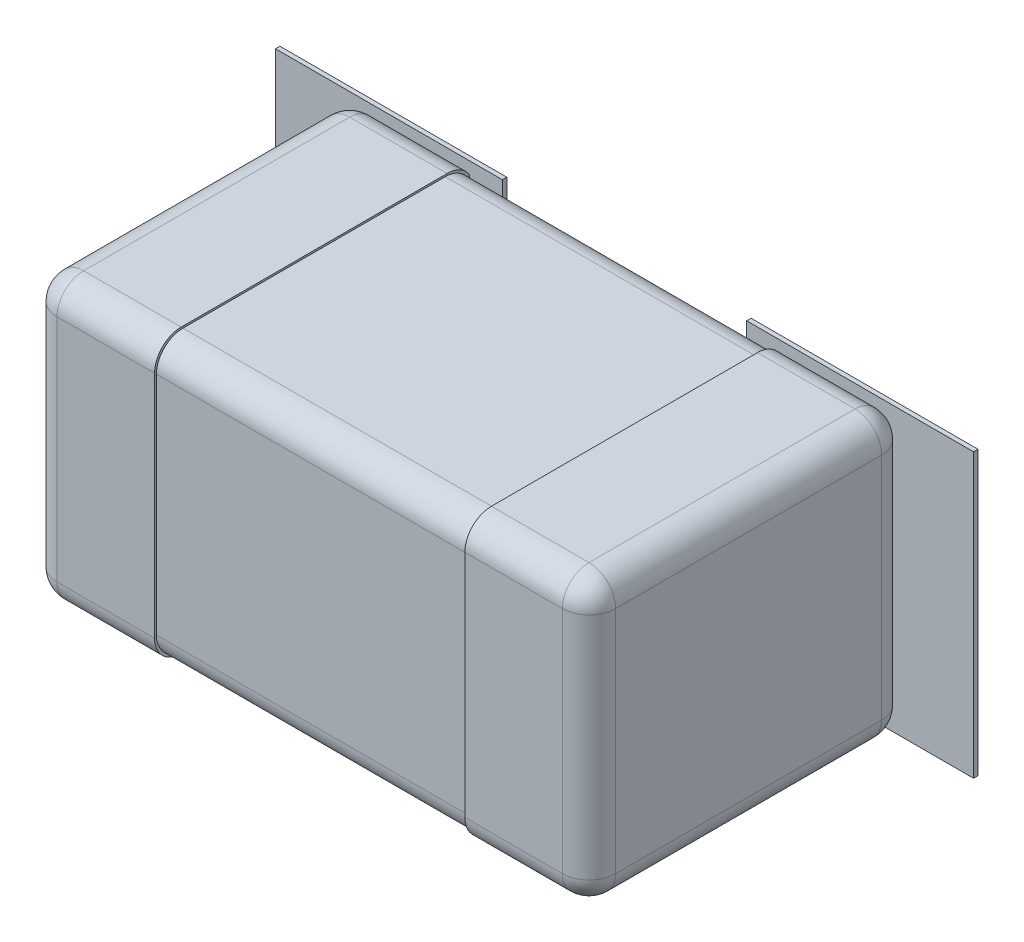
ISO-10303-21;
HEADER;
FILE_DESCRIPTION(('STEP AP214'),'2;1');
FILE_NAME('part.step','',(''),(''),'','','');
FILE_SCHEMA(('AUTOMOTIVE_DESIGN { 1 0 10303 214 1 1 1 1 }'));
ENDSEC;
DATA;
#1=APPLICATION_CONTEXT('core data for automotive mechanical design processes');
#2=APPLICATION_PROTOCOL_DEFINITION('international standard','automotive_design',2000,#1);
#3=PRODUCT_CONTEXT('',#1,'mechanical');
#4=PRODUCT('Part','Part','',(#3));
#5=PRODUCT_RELATED_PRODUCT_CATEGORY('part','',(#4));
#6=PRODUCT_DEFINITION_FORMATION('','',#4);
#7=PRODUCT_DEFINITION_CONTEXT('part definition',#1,'design');
#8=PRODUCT_DEFINITION('design','',#6,#7);
#9=PRODUCT_DEFINITION_SHAPE('','',#8);
#10=(LENGTH_UNIT() NAMED_UNIT(*) SI_UNIT(.MILLI.,.METRE.));
#11=(NAMED_UNIT(*) PLANE_ANGLE_UNIT() SI_UNIT($,.RADIAN.));
#12=(NAMED_UNIT(*) SI_UNIT($,.STERADIAN.) SOLID_ANGLE_UNIT());
#13=UNCERTAINTY_MEASURE_WITH_UNIT(LENGTH_MEASURE(1.E-05),#10,'distance_accuracy_value','');
#14=(GEOMETRIC_REPRESENTATION_CONTEXT(3) GLOBAL_UNCERTAINTY_ASSIGNED_CONTEXT((#13)) GLOBAL_UNIT_ASSIGNED_CONTEXT((#10,
#11,#12)) REPRESENTATION_CONTEXT('',''));
#15=CARTESIAN_POINT('',(0.,0.,0.));
#16=DIRECTION('',(0.,0.,1.));
#17=DIRECTION('',(1.,0.,0.));
#18=AXIS2_PLACEMENT_3D('',#15,#16,#17);
#19=CARTESIAN_POINT('',(0.800000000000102,-0.404999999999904,0.0762));
#20=DIRECTION('',(1.,0.,0.));
#21=DIRECTION('',(0.,0.,-1.));
#22=AXIS2_PLACEMENT_3D('',#19,#20,#21);
#23=PLANE('',#22);
#24=DIRECTION('',(0.,0.,-1.));
#25=VECTOR('',#24,1.);
#26=CARTESIAN_POINT('',(0.800000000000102,0.328799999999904,2.18261184));
#27=LINE('',#26,#25);
#28=CARTESIAN_POINT('',(0.800000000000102,0.328799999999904,0.9144));
#29=VERTEX_POINT('',#28);
#30=CARTESIAN_POINT('',(0.800000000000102,0.328799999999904,0.152399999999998));
#31=VERTEX_POINT('',#30);
#32=EDGE_CURVE('E149',#29,#31,#27,.T.);
#33=ORIENTED_EDGE('',*,*,#32,.F.);
#34=DIRECTION('',(0.,1.,0.));
#35=VECTOR('',#34,1.);
#36=CARTESIAN_POINT('',(0.800000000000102,-1.4609268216,0.9144));
#37=LINE('',#36,#35);
#38=CARTESIAN_POINT('',(0.800000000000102,-0.328799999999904,0.9144));
#39=VERTEX_POINT('',#38);
#40=EDGE_CURVE('E175',#39,#29,#37,.T.);
#41=ORIENTED_EDGE('',*,*,#40,.F.);
#42=DIRECTION('',(0.,0.,-1.));
#43=VECTOR('',#42,1.);
#44=CARTESIAN_POINT('',(0.800000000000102,-0.328799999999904,2.18261184));
#45=LINE('',#44,#43);
#46=CARTESIAN_POINT('',(0.800000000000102,-0.328799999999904,0.1524));
#47=VERTEX_POINT('',#46);
#48=EDGE_CURVE('E157',#47,#39,#45,.F.);
#49=ORIENTED_EDGE('',*,*,#48,.F.);
#50=DIRECTION('',(0.,-1.,0.));
#51=VECTOR('',#50,1.);
#52=CARTESIAN_POINT('',(0.800000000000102,1.4609268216,0.1524));
#53=LINE('',#52,#51);
#54=EDGE_CURVE('E162',#31,#47,#53,.T.);
#55=ORIENTED_EDGE('',*,*,#54,.F.);
#56=EDGE_LOOP('',(#33,#41,#49,#55));
#57=FACE_BOUND('',#56,.T.);
#58=ADVANCED_FACE('F16',(#57),#23,.T.);
#59=CARTESIAN_POINT('',(-0.800000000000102,0.404999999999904,0.0762));
#60=DIRECTION('',(-1.,0.,0.));
#61=DIRECTION('',(0.,0.,1.));
#62=AXIS2_PLACEMENT_3D('',#59,#60,#61);
#63=PLANE('',#62);
#64=DIRECTION('',(0.,0.,-1.));
#65=VECTOR('',#64,1.);
#66=CARTESIAN_POINT('',(-0.800000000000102,0.328799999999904,2.18261184));
#67=LINE('',#66,#65);
#68=CARTESIAN_POINT('',(-0.800000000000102,0.328799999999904,0.1524));
#69=VERTEX_POINT('',#68);
#70=CARTESIAN_POINT('',(-0.800000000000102,0.328799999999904,0.9144));
#71=VERTEX_POINT('',#70);
#72=EDGE_CURVE('E146',#69,#71,#67,.F.);
#73=ORIENTED_EDGE('',*,*,#72,.F.);
#74=DIRECTION('',(0.,1.,0.));
#75=VECTOR('',#74,1.);
#76=CARTESIAN_POINT('',(-0.800000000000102,-1.4609268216,0.1524));
#77=LINE('',#76,#75);
#78=CARTESIAN_POINT('',(-0.800000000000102,-0.328799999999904,0.1524));
#79=VERTEX_POINT('',#78);
#80=EDGE_CURVE('E151',#79,#69,#77,.T.);
#81=ORIENTED_EDGE('',*,*,#80,.F.);
#82=DIRECTION('',(0.,0.,-1.));
#83=VECTOR('',#82,1.);
#84=CARTESIAN_POINT('',(-0.800000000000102,-0.328799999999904,2.18261184));
#85=LINE('',#84,#83);
#86=CARTESIAN_POINT('',(-0.800000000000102,-0.328799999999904,0.9144));
#87=VERTEX_POINT('',#86);
#88=EDGE_CURVE('E113',#87,#79,#85,.T.);
#89=ORIENTED_EDGE('',*,*,#88,.F.);
#90=DIRECTION('',(0.,-1.,0.));
#91=VECTOR('',#90,1.);
#92=CARTESIAN_POINT('',(-0.800000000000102,1.4609268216,0.9144));
#93=LINE('',#92,#91);
#94=EDGE_CURVE('E132',#71,#87,#93,.T.);
#95=ORIENTED_EDGE('',*,*,#94,.F.);
#96=EDGE_LOOP('',(#73,#81,#89,#95));
#97=FACE_BOUND('',#96,.T.);
#98=ADVANCED_FACE('F466',(#97),#63,.T.);
#99=CARTESIAN_POINT('',(-0.723800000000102,-0.328799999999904,2.18261184));
#100=DIRECTION('',(0.,0.,-1.));
#101=DIRECTION('',(-1.,0.,0.));
#102=AXIS2_PLACEMENT_3D('',#99,#100,#101);
#103=CYLINDRICAL_SURFACE('',#102,0.0762);
#104=CARTESIAN_POINT('',(-0.723800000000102,-0.328799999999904,0.1524));
#105=DIRECTION('',(0.,0.,-1.));
#106=DIRECTION('',(-1.,0.,0.));
#107=AXIS2_PLACEMENT_3D('',#104,#105,#106);
#108=CIRCLE('',#107,0.0762);
#109=CARTESIAN_POINT('',(-0.723800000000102,-0.404999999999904,0.1524));
#110=VERTEX_POINT('',#109);
#111=EDGE_CURVE('E665',#110,#79,#108,.T.);
#112=ORIENTED_EDGE('',*,*,#111,.F.);
#113=DIRECTION('',(0.,0.,-1.));
#114=VECTOR('',#113,1.);
#115=CARTESIAN_POINT('',(-0.723800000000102,-0.404999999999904,0.0762));
#116=LINE('',#115,#114);
#117=CARTESIAN_POINT('',(-0.723800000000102,-0.404999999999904,0.914399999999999));
#118=VERTEX_POINT('',#117);
#119=EDGE_CURVE('E130',#118,#110,#116,.T.);
#120=ORIENTED_EDGE('',*,*,#119,.F.);
#121=CARTESIAN_POINT('',(-0.723800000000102,-0.328799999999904,0.9144));
#122=DIRECTION('',(0.,0.,1.));
#123=DIRECTION('',(-0.707106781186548,-0.707106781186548,0.));
#124=AXIS2_PLACEMENT_3D('',#121,#122,#123);
#125=CIRCLE('',#124,0.0762);
#126=CARTESIAN_POINT('',(-0.777681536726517,-0.382681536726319,0.9144));
#127=VERTEX_POINT('',#126);
#128=EDGE_CURVE('E123',#127,#118,#125,.T.);
#129=ORIENTED_EDGE('',*,*,#128,.F.);
#130=CARTESIAN_POINT('',(-0.723800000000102,-0.328799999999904,0.9144));
#131=DIRECTION('',(0.,0.,-1.));
#132=DIRECTION('',(-1.,0.,0.));
#133=AXIS2_PLACEMENT_3D('',#130,#131,#132);
#134=CIRCLE('',#133,0.0762);
#135=EDGE_CURVE('E19',#87,#127,#134,.F.);
#136=ORIENTED_EDGE('',*,*,#135,.F.);
#137=ORIENTED_EDGE('',*,*,#88,.T.);
#138=EDGE_LOOP('',(#112,#120,#129,#136,#137));
#139=FACE_BOUND('',#138,.T.);
#140=ADVANCED_FACE('F128',(#139),#103,.T.);
#141=CARTESIAN_POINT('',(-0.723800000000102,-0.328799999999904,0.9144));
#142=DIRECTION('',(-0.707106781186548,-0.707106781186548,0.));
#143=DIRECTION('',(0.,0.,1.));
#144=AXIS2_PLACEMENT_3D('',#141,#142,#143);
#145=SPHERICAL_SURFACE('',#144,0.0762);
#146=ORIENTED_EDGE('',*,*,#135,.T.);
#147=ORIENTED_EDGE('',*,*,#128,.T.);
#148=CARTESIAN_POINT('',(-0.723800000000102,-0.328799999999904,0.9144));
#149=DIRECTION('',(1.,0.,0.));
#150=DIRECTION('',(0.,0.,-1.));
#151=AXIS2_PLACEMENT_3D('',#148,#149,#150);
#152=CIRCLE('',#151,0.0762);
#153=CARTESIAN_POINT('',(-0.723800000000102,-0.328799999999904,0.9906));
#154=VERTEX_POINT('',#153);
#155=EDGE_CURVE('E622',#154,#118,#152,.T.);
#156=ORIENTED_EDGE('',*,*,#155,.F.);
#157=CARTESIAN_POINT('',(-0.723800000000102,-0.328799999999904,0.9144));
#158=DIRECTION('',(0.,-1.,0.));
#159=DIRECTION('',(0.,0.,-1.));
#160=AXIS2_PLACEMENT_3D('',#157,#158,#159);
#161=CIRCLE('',#160,0.0762);
#162=EDGE_CURVE('E125',#87,#154,#161,.F.);
#163=ORIENTED_EDGE('',*,*,#162,.F.);
#164=EDGE_LOOP('',(#146,#147,#156,#163));
#165=FACE_BOUND('',#164,.T.);
#166=ADVANCED_FACE('F121',(#165),#145,.T.);
#167=CARTESIAN_POINT('',(-0.723800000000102,1.4609268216,0.9144));
#168=DIRECTION('',(0.,-1.,0.));
#169=DIRECTION('',(0.,0.,-1.));
#170=AXIS2_PLACEMENT_3D('',#167,#168,#169);
#171=CYLINDRICAL_SURFACE('',#170,0.0762);
#172=ORIENTED_EDGE('',*,*,#162,.T.);
#173=DIRECTION('',(0.,1.,0.));
#174=VECTOR('',#173,1.);
#175=CARTESIAN_POINT('',(-0.723800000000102,0.,0.9906));
#176=LINE('',#175,#174);
#177=CARTESIAN_POINT('',(-0.723800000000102,0.328799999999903,0.9906));
#178=VERTEX_POINT('',#177);
#179=EDGE_CURVE('E445',#178,#154,#176,.F.);
#180=ORIENTED_EDGE('',*,*,#179,.F.);
#181=CARTESIAN_POINT('',(-0.723800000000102,0.328799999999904,0.9144));
#182=DIRECTION('',(0.,1.,0.));
#183=DIRECTION('',(-0.707106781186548,0.,0.707106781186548));
#184=AXIS2_PLACEMENT_3D('',#181,#182,#183);
#185=CIRCLE('',#184,0.0762);
#186=CARTESIAN_POINT('',(-0.777681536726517,0.328799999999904,0.968281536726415));
#187=VERTEX_POINT('',#186);
#188=EDGE_CURVE('E452',#187,#178,#185,.T.);
#189=ORIENTED_EDGE('',*,*,#188,.F.);
#190=CARTESIAN_POINT('',(-0.723800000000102,0.328799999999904,0.9144));
#191=DIRECTION('',(0.,-1.,0.));
#192=DIRECTION('',(0.,0.,-1.));
#193=AXIS2_PLACEMENT_3D('',#190,#191,#192);
#194=CIRCLE('',#193,0.0762);
#195=EDGE_CURVE('E919',#71,#187,#194,.F.);
#196=ORIENTED_EDGE('',*,*,#195,.F.);
#197=ORIENTED_EDGE('',*,*,#94,.T.);
#198=EDGE_LOOP('',(#172,#180,#189,#196,#197));
#199=FACE_BOUND('',#198,.T.);
#200=ADVANCED_FACE('F458',(#199),#171,.T.);
#201=CARTESIAN_POINT('',(-0.723800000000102,0.328799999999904,0.9144));
#202=DIRECTION('',(-0.707106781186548,0.,0.707106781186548));
#203=DIRECTION('',(0.,1.,0.));
#204=AXIS2_PLACEMENT_3D('',#201,#202,#203);
#205=SPHERICAL_SURFACE('',#204,0.0762);
#206=ORIENTED_EDGE('',*,*,#195,.T.);
#207=ORIENTED_EDGE('',*,*,#188,.T.);
#208=CARTESIAN_POINT('',(-0.723800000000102,0.328799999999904,0.9144));
#209=DIRECTION('',(-1.,0.,0.));
#210=DIRECTION('',(0.,0.,1.));
#211=AXIS2_PLACEMENT_3D('',#208,#209,#210);
#212=CIRCLE('',#211,0.0762);
#213=CARTESIAN_POINT('',(-0.723800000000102,0.404999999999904,0.9144));
#214=VERTEX_POINT('',#213);
#215=EDGE_CURVE('E617',#214,#178,#212,.F.);
#216=ORIENTED_EDGE('',*,*,#215,.F.);
#217=CARTESIAN_POINT('',(-0.723800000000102,0.328799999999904,0.9144));
#218=DIRECTION('',(0.,0.,-1.));
#219=DIRECTION('',(-1.,0.,0.));
#220=AXIS2_PLACEMENT_3D('',#217,#218,#219);
#221=CIRCLE('',#220,0.0762);
#222=EDGE_CURVE('E150',#71,#214,#221,.T.);
#223=ORIENTED_EDGE('',*,*,#222,.F.);
#224=EDGE_LOOP('',(#206,#207,#216,#223));
#225=FACE_BOUND('',#224,.T.);
#226=ADVANCED_FACE('F454',(#225),#205,.T.);
#227=CARTESIAN_POINT('',(-0.723800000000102,0.328799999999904,2.18261184));
#228=DIRECTION('',(0.,0.,-1.));
#229=DIRECTION('',(-1.,0.,0.));
#230=AXIS2_PLACEMENT_3D('',#227,#228,#229);
#231=CYLINDRICAL_SURFACE('',#230,0.0762);
#232=CARTESIAN_POINT('',(-0.723800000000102,0.328799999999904,0.1524));
#233=DIRECTION('',(0.,0.,-1.));
#234=DIRECTION('',(-1.,0.,0.));
#235=AXIS2_PLACEMENT_3D('',#232,#233,#234);
#236=CIRCLE('',#235,0.0762);
#237=CARTESIAN_POINT('',(-0.777681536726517,0.382681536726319,0.1524));
#238=VERTEX_POINT('',#237);
#239=EDGE_CURVE('E663',#69,#238,#236,.T.);
#240=ORIENTED_EDGE('',*,*,#239,.F.);
#241=ORIENTED_EDGE('',*,*,#72,.T.);
#242=ORIENTED_EDGE('',*,*,#222,.T.);
#243=DIRECTION('',(0.,0.,1.));
#244=VECTOR('',#243,1.);
#245=CARTESIAN_POINT('',(-0.723800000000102,0.404999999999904,0.0762));
#246=LINE('',#245,#244);
#247=CARTESIAN_POINT('',(-0.723800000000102,0.404999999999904,0.1524));
#248=VERTEX_POINT('',#247);
#249=EDGE_CURVE('E440',#248,#214,#246,.T.);
#250=ORIENTED_EDGE('',*,*,#249,.F.);
#251=CARTESIAN_POINT('',(-0.723800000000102,0.328799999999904,0.1524));
#252=DIRECTION('',(0.,0.,-1.));
#253=DIRECTION('',(-0.707106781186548,0.707106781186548,0.));
#254=AXIS2_PLACEMENT_3D('',#251,#252,#253);
#255=CIRCLE('',#254,0.0762);
#256=EDGE_CURVE('E387',#238,#248,#255,.T.);
#257=ORIENTED_EDGE('',*,*,#256,.F.);
#258=EDGE_LOOP('',(#240,#241,#242,#250,#257));
#259=FACE_BOUND('',#258,.T.);
#260=ADVANCED_FACE('F457',(#259),#231,.T.);
#261=CARTESIAN_POINT('',(0.723800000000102,0.328799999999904,2.18261184));
#262=DIRECTION('',(0.,0.,-1.));
#263=DIRECTION('',(-1.,0.,0.));
#264=AXIS2_PLACEMENT_3D('',#261,#262,#263);
#265=CYLINDRICAL_SURFACE('',#264,0.0762);
#266=CARTESIAN_POINT('',(0.723800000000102,0.328799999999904,0.1524));
#267=DIRECTION('',(0.,0.,-1.));
#268=DIRECTION('',(-1.,0.,0.));
#269=AXIS2_PLACEMENT_3D('',#266,#267,#268);
#270=CIRCLE('',#269,0.0762);
#271=CARTESIAN_POINT('',(0.723800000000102,0.404999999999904,0.1524));
#272=VERTEX_POINT('',#271);
#273=CARTESIAN_POINT('',(0.777681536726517,0.382681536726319,0.1524));
#274=VERTEX_POINT('',#273);
#275=EDGE_CURVE('E324',#272,#274,#270,.T.);
#276=ORIENTED_EDGE('',*,*,#275,.F.);
#277=DIRECTION('',(0.,0.,1.));
#278=VECTOR('',#277,1.);
#279=CARTESIAN_POINT('',(0.723800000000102,0.404999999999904,0.0762));
#280=LINE('',#279,#278);
#281=CARTESIAN_POINT('',(0.723800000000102,0.404999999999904,0.9144));
#282=VERTEX_POINT('',#281);
#283=EDGE_CURVE('E439',#282,#272,#280,.F.);
#284=ORIENTED_EDGE('',*,*,#283,.F.);
#285=CARTESIAN_POINT('',(0.723800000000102,0.328799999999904,0.9144));
#286=DIRECTION('',(0.,0.,-1.));
#287=DIRECTION('',(-1.,0.,0.));
#288=AXIS2_PLACEMENT_3D('',#285,#286,#287);
#289=CIRCLE('',#288,0.0762);
#290=EDGE_CURVE('E167',#29,#282,#289,.F.);
#291=ORIENTED_EDGE('',*,*,#290,.F.);
#292=ORIENTED_EDGE('',*,*,#32,.T.);
#293=CARTESIAN_POINT('',(0.723800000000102,0.328799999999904,0.1524));
#294=DIRECTION('',(0.,0.,-1.));
#295=DIRECTION('',(0.707106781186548,0.707106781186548,0.));
#296=AXIS2_PLACEMENT_3D('',#293,#294,#295);
#297=CIRCLE('',#296,0.0762);
#298=EDGE_CURVE('E321',#274,#31,#297,.T.);
#299=ORIENTED_EDGE('',*,*,#298,.F.);
#300=EDGE_LOOP('',(#276,#284,#291,#292,#299));
#301=FACE_BOUND('',#300,.T.);
#302=ADVANCED_FACE('F433',(#301),#265,.T.);
#303=CARTESIAN_POINT('',(0.723800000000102,0.328799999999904,0.9144));
#304=DIRECTION('',(0.,0.707106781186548,0.707106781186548));
#305=DIRECTION('',(1.,0.,0.));
#306=AXIS2_PLACEMENT_3D('',#303,#304,#305);
#307=SPHERICAL_SURFACE('',#306,0.0762);
#308=CARTESIAN_POINT('',(0.723800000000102,0.328799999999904,0.9144));
#309=DIRECTION('',(0.,1.,0.));
#310=DIRECTION('',(0.,0.,1.));
#311=AXIS2_PLACEMENT_3D('',#308,#309,#310);
#312=CIRCLE('',#311,0.0762);
#313=CARTESIAN_POINT('',(0.723800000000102,0.328799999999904,0.9906));
#314=VERTEX_POINT('',#313);
#315=EDGE_CURVE('E178',#29,#314,#312,.F.);
#316=ORIENTED_EDGE('',*,*,#315,.F.);
#317=ORIENTED_EDGE('',*,*,#290,.T.);
#318=CARTESIAN_POINT('',(0.723800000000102,0.328799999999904,0.9144));
#319=DIRECTION('',(-1.,0.,0.));
#320=DIRECTION('',(0.,0.,1.));
#321=AXIS2_PLACEMENT_3D('',#318,#319,#320);
#322=CIRCLE('',#321,0.0762);
#323=CARTESIAN_POINT('',(0.723800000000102,0.382681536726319,0.968281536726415));
#324=VERTEX_POINT('',#323);
#325=EDGE_CURVE('E588',#324,#282,#322,.T.);
#326=ORIENTED_EDGE('',*,*,#325,.F.);
#327=CARTESIAN_POINT('',(0.723800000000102,0.328799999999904,0.9144));
#328=DIRECTION('',(-1.,0.,0.));
#329=DIRECTION('',(0.,0.,1.));
#330=AXIS2_PLACEMENT_3D('',#327,#328,#329);
#331=CIRCLE('',#330,0.0762);
#332=EDGE_CURVE('E592',#314,#324,#331,.T.);
#333=ORIENTED_EDGE('',*,*,#332,.F.);
#334=EDGE_LOOP('',(#316,#317,#326,#333));
#335=FACE_BOUND('',#334,.T.);
#336=ADVANCED_FACE('F428',(#335),#307,.T.);
#337=CARTESIAN_POINT('',(0.723800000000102,-1.4609268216,0.9144));
#338=DIRECTION('',(0.,1.,0.));
#339=DIRECTION('',(0.,0.,1.));
#340=AXIS2_PLACEMENT_3D('',#337,#338,#339);
#341=CYLINDRICAL_SURFACE('',#340,0.0762);
#342=CARTESIAN_POINT('',(0.723800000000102,-0.328799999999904,0.9144));
#343=DIRECTION('',(0.,1.,0.));
#344=DIRECTION('',(0.,0.,1.));
#345=AXIS2_PLACEMENT_3D('',#342,#343,#344);
#346=CIRCLE('',#345,0.0762);
#347=CARTESIAN_POINT('',(0.777681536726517,-0.328799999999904,0.968281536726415));
#348=VERTEX_POINT('',#347);
#349=EDGE_CURVE('E177',#39,#348,#346,.F.);
#350=ORIENTED_EDGE('',*,*,#349,.F.);
#351=ORIENTED_EDGE('',*,*,#40,.T.);
#352=ORIENTED_EDGE('',*,*,#315,.T.);
#353=DIRECTION('',(0.,1.,0.));
#354=VECTOR('',#353,1.);
#355=CARTESIAN_POINT('',(0.723800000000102,0.,0.9906));
#356=LINE('',#355,#354);
#357=CARTESIAN_POINT('',(0.723800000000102,-0.328799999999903,0.9906));
#358=VERTEX_POINT('',#357);
#359=EDGE_CURVE('E408',#358,#314,#356,.T.);
#360=ORIENTED_EDGE('',*,*,#359,.F.);
#361=CARTESIAN_POINT('',(0.723800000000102,-0.328799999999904,0.9144));
#362=DIRECTION('',(0.,-1.,0.));
#363=DIRECTION('',(0.707106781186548,0.,0.707106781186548));
#364=AXIS2_PLACEMENT_3D('',#361,#362,#363);
#365=CIRCLE('',#364,0.0762);
#366=EDGE_CURVE('E415',#348,#358,#365,.T.);
#367=ORIENTED_EDGE('',*,*,#366,.F.);
#368=EDGE_LOOP('',(#350,#351,#352,#360,#367));
#369=FACE_BOUND('',#368,.T.);
#370=ADVANCED_FACE('F423',(#369),#341,.T.);
#371=CARTESIAN_POINT('',(0.723800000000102,-0.328799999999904,0.9144));
#372=DIRECTION('',(0.707106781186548,0.,0.707106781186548));
#373=DIRECTION('',(0.,-1.,0.));
#374=AXIS2_PLACEMENT_3D('',#371,#372,#373);
#375=SPHERICAL_SURFACE('',#374,0.0762);
#376=ORIENTED_EDGE('',*,*,#366,.T.);
#377=CARTESIAN_POINT('',(0.723800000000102,-0.328799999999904,0.9144));
#378=DIRECTION('',(1.,0.,0.));
#379=DIRECTION('',(0.,0.,-1.));
#380=AXIS2_PLACEMENT_3D('',#377,#378,#379);
#381=CIRCLE('',#380,0.0762);
#382=CARTESIAN_POINT('',(0.723800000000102,-0.404999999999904,0.9144));
#383=VERTEX_POINT('',#382);
#384=EDGE_CURVE('E411',#383,#358,#381,.F.);
#385=ORIENTED_EDGE('',*,*,#384,.F.);
#386=CARTESIAN_POINT('',(0.723800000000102,-0.328799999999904,0.9144));
#387=DIRECTION('',(0.,0.,-1.));
#388=DIRECTION('',(-1.,0.,0.));
#389=AXIS2_PLACEMENT_3D('',#386,#387,#388);
#390=CIRCLE('',#389,0.0762);
#391=EDGE_CURVE('E161',#39,#383,#390,.T.);
#392=ORIENTED_EDGE('',*,*,#391,.F.);
#393=ORIENTED_EDGE('',*,*,#349,.T.);
#394=EDGE_LOOP('',(#376,#385,#392,#393));
#395=FACE_BOUND('',#394,.T.);
#396=ADVANCED_FACE('F418',(#395),#375,.T.);
#397=CARTESIAN_POINT('',(0.723800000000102,-0.328799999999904,2.18261184));
#398=DIRECTION('',(0.,0.,-1.));
#399=DIRECTION('',(-1.,0.,0.));
#400=AXIS2_PLACEMENT_3D('',#397,#398,#399);
#401=CYLINDRICAL_SURFACE('',#400,0.0762);
#402=CARTESIAN_POINT('',(0.723800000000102,-0.328799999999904,0.1524));
#403=DIRECTION('',(0.,0.,-1.));
#404=DIRECTION('',(-1.,0.,0.));
#405=AXIS2_PLACEMENT_3D('',#402,#403,#404);
#406=CIRCLE('',#405,0.0762);
#407=CARTESIAN_POINT('',(0.777681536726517,-0.382681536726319,0.1524));
#408=VERTEX_POINT('',#407);
#409=EDGE_CURVE('E908',#47,#408,#406,.T.);
#410=ORIENTED_EDGE('',*,*,#409,.F.);
#411=ORIENTED_EDGE('',*,*,#48,.T.);
#412=ORIENTED_EDGE('',*,*,#391,.T.);
#413=DIRECTION('',(0.,0.,-1.));
#414=VECTOR('',#413,1.);
#415=CARTESIAN_POINT('',(0.723800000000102,-0.404999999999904,0.0762));
#416=LINE('',#415,#414);
#417=CARTESIAN_POINT('',(0.723800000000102,-0.404999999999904,0.1524));
#418=VERTEX_POINT('',#417);
#419=EDGE_CURVE('E403',#418,#383,#416,.F.);
#420=ORIENTED_EDGE('',*,*,#419,.F.);
#421=CARTESIAN_POINT('',(0.723800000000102,-0.328799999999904,0.1524));
#422=DIRECTION('',(0.,0.,-1.));
#423=DIRECTION('',(0.707106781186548,-0.707106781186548,0.));
#424=AXIS2_PLACEMENT_3D('',#421,#422,#423);
#425=CIRCLE('',#424,0.0762);
#426=EDGE_CURVE('E319',#408,#418,#425,.T.);
#427=ORIENTED_EDGE('',*,*,#426,.F.);
#428=EDGE_LOOP('',(#410,#411,#412,#420,#427));
#429=FACE_BOUND('',#428,.T.);
#430=ADVANCED_FACE('F422',(#429),#401,.T.);
#431=CARTESIAN_POINT('',(0.,0.,0.0762));
#432=DIRECTION('',(0.,0.,1.));
#433=DIRECTION('',(1.,0.,0.));
#434=AXIS2_PLACEMENT_3D('',#431,#432,#433);
#435=PLANE('',#434);
#436=DIRECTION('',(1.,0.,0.));
#437=VECTOR('',#436,1.);
#438=CARTESIAN_POINT('',(-0.999871,-0.405003,0.0762));
#439=LINE('',#438,#437);
#440=CARTESIAN_POINT('',(-0.999871,-0.405003,0.0762));
#441=VERTEX_POINT('',#440);
#442=CARTESIAN_POINT('',(-0.349885,-0.405003,0.0762));
#443=VERTEX_POINT('',#442);
#444=EDGE_CURVE('E397',#441,#443,#439,.T.);
#445=ORIENTED_EDGE('',*,*,#444,.F.);
#446=DIRECTION('',(0.,1.,0.));
#447=VECTOR('',#446,1.);
#448=CARTESIAN_POINT('',(-0.999871,0.405003,0.0762));
#449=LINE('',#448,#447);
#450=CARTESIAN_POINT('',(-0.999871,0.405003,0.0762));
#451=VERTEX_POINT('',#450);
#452=EDGE_CURVE('E139',#451,#441,#449,.F.);
#453=ORIENTED_EDGE('',*,*,#452,.F.);
#454=DIRECTION('',(1.,0.,0.));
#455=VECTOR('',#454,1.);
#456=CARTESIAN_POINT('',(-0.349885,0.405003,0.0762));
#457=LINE('',#456,#455);
#458=CARTESIAN_POINT('',(-0.349885,0.405003,0.0762));
#459=VERTEX_POINT('',#458);
#460=EDGE_CURVE('E384',#459,#451,#457,.F.);
#461=ORIENTED_EDGE('',*,*,#460,.F.);
#462=DIRECTION('',(0.,1.,0.));
#463=VECTOR('',#462,1.);
#464=CARTESIAN_POINT('',(-0.349885,-0.405003,0.0762));
#465=LINE('',#464,#463);
#466=EDGE_CURVE('E390',#443,#459,#465,.T.);
#467=ORIENTED_EDGE('',*,*,#466,.F.);
#468=EDGE_LOOP('',(#445,#453,#461,#467));
#469=FACE_BOUND('',#468,.T.);
#470=ADVANCED_FACE('F976',(#469),#435,.F.);
#471=CARTESIAN_POINT('',(0.,0.,0.0762));
#472=DIRECTION('',(0.,0.,1.));
#473=DIRECTION('',(1.,0.,0.));
#474=AXIS2_PLACEMENT_3D('',#471,#472,#473);
#475=PLANE('',#474);
#476=DIRECTION('',(1.,0.,0.));
#477=VECTOR('',#476,1.);
#478=CARTESIAN_POINT('',(0.349885,-0.405003,0.0762));
#479=LINE('',#478,#477);
#480=CARTESIAN_POINT('',(0.349885,-0.405003,0.0762));
#481=VERTEX_POINT('',#480);
#482=CARTESIAN_POINT('',(0.999871,-0.405003,0.0762));
#483=VERTEX_POINT('',#482);
#484=EDGE_CURVE('E160',#481,#483,#479,.T.);
#485=ORIENTED_EDGE('',*,*,#484,.F.);
#486=DIRECTION('',(0.,1.,0.));
#487=VECTOR('',#486,1.);
#488=CARTESIAN_POINT('',(0.349885,0.405003,0.0762));
#489=LINE('',#488,#487);
#490=CARTESIAN_POINT('',(0.349885,0.405003,0.0762));
#491=VERTEX_POINT('',#490);
#492=EDGE_CURVE('E335',#491,#481,#489,.F.);
#493=ORIENTED_EDGE('',*,*,#492,.F.);
#494=DIRECTION('',(1.,0.,0.));
#495=VECTOR('',#494,1.);
#496=CARTESIAN_POINT('',(0.999871,0.405003,0.0762));
#497=LINE('',#496,#495);
#498=CARTESIAN_POINT('',(0.999871,0.405003,0.0762));
#499=VERTEX_POINT('',#498);
#500=EDGE_CURVE('E345',#499,#491,#497,.F.);
#501=ORIENTED_EDGE('',*,*,#500,.F.);
#502=DIRECTION('',(0.,1.,0.));
#503=VECTOR('',#502,1.);
#504=CARTESIAN_POINT('',(0.999871,-0.405003,0.0762));
#505=LINE('',#504,#503);
#506=EDGE_CURVE('E168',#483,#499,#505,.T.);
#507=ORIENTED_EDGE('',*,*,#506,.F.);
#508=EDGE_LOOP('',(#485,#493,#501,#507));
#509=FACE_BOUND('',#508,.T.);
#510=ADVANCED_FACE('F980',(#509),#475,.F.);
#511=CARTESIAN_POINT('',(0.349885,-0.405003,0.0762));
#512=DIRECTION('',(0.,-1.,0.));
#513=DIRECTION('',(0.,0.,-1.));
#514=AXIS2_PLACEMENT_3D('',#511,#512,#513);
#515=PLANE('',#514);
#516=DIRECTION('',(0.,0.,1.));
#517=VECTOR('',#516,1.);
#518=CARTESIAN_POINT('',(0.349885,-0.405003,0.0762));
#519=LINE('',#518,#517);
#520=CARTESIAN_POINT('',(0.349885,-0.405003,0.0889));
#521=VERTEX_POINT('',#520);
#522=EDGE_CURVE('E362',#481,#521,#519,.T.);
#523=ORIENTED_EDGE('',*,*,#522,.F.);
#524=ORIENTED_EDGE('',*,*,#484,.T.);
#525=DIRECTION('',(0.,0.,-1.));
#526=VECTOR('',#525,1.);
#527=CARTESIAN_POINT('',(0.999871,-0.405003,0.0762));
#528=LINE('',#527,#526);
#529=CARTESIAN_POINT('',(0.999871,-0.405003,0.0889));
#530=VERTEX_POINT('',#529);
#531=EDGE_CURVE('E172',#530,#483,#528,.T.);
#532=ORIENTED_EDGE('',*,*,#531,.F.);
#533=DIRECTION('',(1.,0.,0.));
#534=VECTOR('',#533,1.);
#535=CARTESIAN_POINT('',(0.,-0.405003,0.0889));
#536=LINE('',#535,#534);
#537=EDGE_CURVE('E350',#521,#530,#536,.T.);
#538=ORIENTED_EDGE('',*,*,#537,.F.);
#539=EDGE_LOOP('',(#523,#524,#532,#538));
#540=FACE_BOUND('',#539,.T.);
#541=ADVANCED_FACE('F985',(#540),#515,.T.);
#542=CARTESIAN_POINT('',(0.999871,-0.405003,0.0762));
#543=DIRECTION('',(1.,0.,0.));
#544=DIRECTION('',(0.,0.,-1.));
#545=AXIS2_PLACEMENT_3D('',#542,#543,#544);
#546=PLANE('',#545);
#547=ORIENTED_EDGE('',*,*,#531,.T.);
#548=ORIENTED_EDGE('',*,*,#506,.T.);
#549=DIRECTION('',(0.,0.,1.));
#550=VECTOR('',#549,1.);
#551=CARTESIAN_POINT('',(0.999871,0.405003,0.0762));
#552=LINE('',#551,#550);
#553=CARTESIAN_POINT('',(0.999871,0.405003,0.0889));
#554=VERTEX_POINT('',#553);
#555=EDGE_CURVE('E171',#554,#499,#552,.F.);
#556=ORIENTED_EDGE('',*,*,#555,.F.);
#557=DIRECTION('',(0.,1.,0.));
#558=VECTOR('',#557,1.);
#559=CARTESIAN_POINT('',(0.999871,0.,0.0889));
#560=LINE('',#559,#558);
#561=EDGE_CURVE('E340',#530,#554,#560,.T.);
#562=ORIENTED_EDGE('',*,*,#561,.F.);
#563=EDGE_LOOP('',(#547,#548,#556,#562));
#564=FACE_BOUND('',#563,.T.);
#565=ADVANCED_FACE('F990',(#564),#546,.T.);
#566=CARTESIAN_POINT('',(0.999871,0.405003,0.0762));
#567=DIRECTION('',(0.,1.,0.));
#568=DIRECTION('',(0.,0.,1.));
#569=AXIS2_PLACEMENT_3D('',#566,#567,#568);
#570=PLANE('',#569);
#571=ORIENTED_EDGE('',*,*,#555,.T.);
#572=ORIENTED_EDGE('',*,*,#500,.T.);
#573=DIRECTION('',(0.,0.,1.));
#574=VECTOR('',#573,1.);
#575=CARTESIAN_POINT('',(0.349885,0.405003,0.0762));
#576=LINE('',#575,#574);
#577=CARTESIAN_POINT('',(0.349885,0.405003,0.0889));
#578=VERTEX_POINT('',#577);
#579=EDGE_CURVE('E332',#578,#491,#576,.F.);
#580=ORIENTED_EDGE('',*,*,#579,.F.);
#581=DIRECTION('',(1.,0.,0.));
#582=VECTOR('',#581,1.);
#583=CARTESIAN_POINT('',(0.,0.405003,0.0889));
#584=LINE('',#583,#582);
#585=EDGE_CURVE('E329',#554,#578,#584,.F.);
#586=ORIENTED_EDGE('',*,*,#585,.F.);
#587=EDGE_LOOP('',(#571,#572,#580,#586));
#588=FACE_BOUND('',#587,.T.);
#589=ADVANCED_FACE('F313',(#588),#570,.T.);
#590=CARTESIAN_POINT('',(0.723800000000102,0.328799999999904,0.1524));
#591=DIRECTION('',(0.707106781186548,0.707106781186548,0.));
#592=DIRECTION('',(0.,0.,-1.));
#593=AXIS2_PLACEMENT_3D('',#590,#591,#592);
#594=SPHERICAL_SURFACE('',#593,0.0762);
#595=CARTESIAN_POINT('',(0.723800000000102,0.328799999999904,0.1524));
#596=DIRECTION('',(0.,-1.,0.));
#597=DIRECTION('',(0.,0.,-1.));
#598=AXIS2_PLACEMENT_3D('',#595,#596,#597);
#599=CIRCLE('',#598,0.0762);
#600=CARTESIAN_POINT('',(0.765921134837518,0.328799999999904,0.0889));
#601=VERTEX_POINT('',#600);
#602=EDGE_CURVE('E165',#601,#31,#599,.T.);
#603=ORIENTED_EDGE('',*,*,#602,.F.);
#604=CARTESIAN_POINT('',(0.723800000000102,0.370921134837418,0.0889));
#605=CARTESIAN_POINT('',(0.72854767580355,0.370952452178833,0.0888999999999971));
#606=CARTESIAN_POINT('',(0.733275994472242,0.370123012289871,0.0889000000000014));
#607=CARTESIAN_POINT('',(0.742208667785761,0.366970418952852,0.0889000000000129));
#608=CARTESIAN_POINT('',(0.746413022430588,0.364647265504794,0.0889000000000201));
#609=CARTESIAN_POINT('',(0.753812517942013,0.358735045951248,0.088900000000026));
#610=CARTESIAN_POINT('',(0.757007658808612,0.355145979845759,0.0889000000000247));
#611=CARTESIAN_POINT('',(0.762025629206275,0.34710875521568,0.0889000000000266));
#612=CARTESIAN_POINT('',(0.76384845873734,0.342660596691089,0.0889000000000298));
#613=CARTESIAN_POINT('',(0.765581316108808,0.335011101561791,0.088900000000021));
#614=CARTESIAN_POINT('',(0.765932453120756,0.331903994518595,0.0889000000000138));
#615=CARTESIAN_POINT('',(0.765921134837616,0.328799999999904,0.0889));
#616=B_SPLINE_CURVE_WITH_KNOTS('',3,(#604,#605,#606,#607,#608,#609,#610,#611,#612,#613,#614,
#615),.UNSPECIFIED.,.F.,.F.,(4,2,2,2,2,4),(0.,0.0141430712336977,0.028286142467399,
0.0424292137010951,0.0565722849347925,0.0658755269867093),.UNSPECIFIED.);
#617=CARTESIAN_POINT('',(0.723800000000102,0.370921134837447,0.0889));
#618=VERTEX_POINT('',#617);
#619=EDGE_CURVE('E296',#618,#601,#616,.T.);
#620=ORIENTED_EDGE('',*,*,#619,.F.);
#621=CARTESIAN_POINT('',(0.723800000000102,0.328799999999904,0.1524));
#622=DIRECTION('',(1.,0.,0.));
#623=DIRECTION('',(0.,0.,-1.));
#624=AXIS2_PLACEMENT_3D('',#621,#622,#623);
#625=CIRCLE('',#624,0.0762);
#626=EDGE_CURVE('E598',#272,#618,#625,.F.);
#627=ORIENTED_EDGE('',*,*,#626,.F.);
#628=ORIENTED_EDGE('',*,*,#275,.T.);
#629=ORIENTED_EDGE('',*,*,#298,.T.);
#630=EDGE_LOOP('',(#603,#620,#627,#628,#629));
#631=FACE_BOUND('',#630,.T.);
#632=ADVANCED_FACE('F306',(#631),#594,.T.);
#633=CARTESIAN_POINT('',(0.723800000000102,1.4609268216,0.1524));
#634=DIRECTION('',(0.,-1.,0.));
#635=DIRECTION('',(0.,0.,-1.));
#636=AXIS2_PLACEMENT_3D('',#633,#634,#635);
#637=CYLINDRICAL_SURFACE('',#636,0.0762);
#638=CARTESIAN_POINT('',(0.723800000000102,-0.328799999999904,0.1524));
#639=DIRECTION('',(0.,-1.,0.));
#640=DIRECTION('',(0.,0.,-1.));
#641=AXIS2_PLACEMENT_3D('',#638,#639,#640);
#642=CIRCLE('',#641,0.0762);
#643=CARTESIAN_POINT('',(0.765921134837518,-0.328799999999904,0.0889));
#644=VERTEX_POINT('',#643);
#645=EDGE_CURVE('E164',#644,#47,#642,.T.);
#646=ORIENTED_EDGE('',*,*,#645,.F.);
#647=DIRECTION('',(0.,1.,0.));
#648=VECTOR('',#647,1.);
#649=CARTESIAN_POINT('',(0.76592113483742,0.,0.0889));
#650=LINE('',#649,#648);
#651=EDGE_CURVE('E302',#601,#644,#650,.F.);
#652=ORIENTED_EDGE('',*,*,#651,.F.);
#653=ORIENTED_EDGE('',*,*,#602,.T.);
#654=ORIENTED_EDGE('',*,*,#54,.T.);
#655=EDGE_LOOP('',(#646,#652,#653,#654));
#656=FACE_BOUND('',#655,.T.);
#657=ADVANCED_FACE('F312',(#656),#637,.T.);
#658=CARTESIAN_POINT('',(0.723800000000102,-0.328799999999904,0.1524));
#659=DIRECTION('',(0.707106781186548,-0.707106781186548,0.));
#660=DIRECTION('',(0.,0.,-1.));
#661=AXIS2_PLACEMENT_3D('',#658,#659,#660);
#662=SPHERICAL_SURFACE('',#661,0.0762);
#663=CARTESIAN_POINT('',(0.723800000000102,-0.328799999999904,0.1524));
#664=DIRECTION('',(-1.,0.,0.));
#665=DIRECTION('',(0.,0.,1.));
#666=AXIS2_PLACEMENT_3D('',#663,#664,#665);
#667=CIRCLE('',#666,0.0762);
#668=CARTESIAN_POINT('',(0.723800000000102,-0.370921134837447,0.0889));
#669=VERTEX_POINT('',#668);
#670=EDGE_CURVE('E578',#669,#418,#667,.T.);
#671=ORIENTED_EDGE('',*,*,#670,.F.);
#672=CARTESIAN_POINT('',(0.765921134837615,-0.328799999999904,0.0889));
#673=CARTESIAN_POINT('',(0.765952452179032,-0.333547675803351,0.0888999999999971));
#674=CARTESIAN_POINT('',(0.765123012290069,-0.338275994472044,0.0889000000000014));
#675=CARTESIAN_POINT('',(0.76197041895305,-0.347208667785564,0.0889000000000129));
#676=CARTESIAN_POINT('',(0.759647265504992,-0.35141302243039,0.0889000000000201));
#677=CARTESIAN_POINT('',(0.753735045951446,-0.358812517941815,0.088900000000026));
#678=CARTESIAN_POINT('',(0.750145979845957,-0.362007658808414,0.0889000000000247));
#679=CARTESIAN_POINT('',(0.742108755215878,-0.367025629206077,0.0889000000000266));
#680=CARTESIAN_POINT('',(0.737660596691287,-0.368848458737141,0.0889000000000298));
#681=CARTESIAN_POINT('',(0.730011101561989,-0.37058131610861,0.088900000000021));
#682=CARTESIAN_POINT('',(0.726903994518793,-0.370932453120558,0.0889000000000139));
#683=CARTESIAN_POINT('',(0.723800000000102,-0.370921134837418,0.0889));
#684=B_SPLINE_CURVE_WITH_KNOTS('',3,(#672,#673,#674,#675,#676,#677,#678,#679,#680,#681,#682,
#683),.UNSPECIFIED.,.F.,.F.,(4,2,2,2,2,4),(0.,0.0141430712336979,0.0282861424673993,
0.0424292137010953,0.0565722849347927,0.0658755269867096),.UNSPECIFIED.);
#685=EDGE_CURVE('E290',#644,#669,#684,.T.);
#686=ORIENTED_EDGE('',*,*,#685,.F.);
#687=ORIENTED_EDGE('',*,*,#645,.T.);
#688=ORIENTED_EDGE('',*,*,#409,.T.);
#689=ORIENTED_EDGE('',*,*,#426,.T.);
#690=EDGE_LOOP('',(#671,#686,#687,#688,#689));
#691=FACE_BOUND('',#690,.T.);
#692=ADVANCED_FACE('F672',(#691),#662,.T.);
#693=CARTESIAN_POINT('',(-0.723800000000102,-0.328799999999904,0.1524));
#694=DIRECTION('',(-0.707106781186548,0.,-0.707106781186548));
#695=DIRECTION('',(0.,-1.,0.));
#696=AXIS2_PLACEMENT_3D('',#693,#694,#695);
#697=SPHERICAL_SURFACE('',#696,0.0762);
#698=CARTESIAN_POINT('',(-0.723800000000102,-0.328799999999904,0.1524));
#699=DIRECTION('',(0.,1.,0.));
#700=DIRECTION('',(0.,0.,1.));
#701=AXIS2_PLACEMENT_3D('',#698,#699,#700);
#702=CIRCLE('',#701,0.0762);
#703=CARTESIAN_POINT('',(-0.765921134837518,-0.328799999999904,0.0889));
#704=VERTEX_POINT('',#703);
#705=CARTESIAN_POINT('',(-0.777681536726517,-0.328799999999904,0.0985184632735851));
#706=VERTEX_POINT('',#705);
#707=EDGE_CURVE('E34',#704,#706,#702,.T.);
#708=ORIENTED_EDGE('',*,*,#707,.F.);
#709=CARTESIAN_POINT('',(-0.723800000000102,-0.370921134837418,0.0888999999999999));
#710=CARTESIAN_POINT('',(-0.728547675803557,-0.370952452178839,0.0889000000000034));
#711=CARTESIAN_POINT('',(-0.733275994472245,-0.37012301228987,0.0889000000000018));
#712=CARTESIAN_POINT('',(-0.742208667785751,-0.366970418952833,0.0888999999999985));
#713=CARTESIAN_POINT('',(-0.746413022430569,-0.364647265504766,0.0888999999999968));
#714=CARTESIAN_POINT('',(-0.753812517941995,-0.358735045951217,0.0889000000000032));
#715=CARTESIAN_POINT('',(-0.757007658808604,-0.355145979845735,0.0889000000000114));
#716=CARTESIAN_POINT('',(-0.762025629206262,-0.347108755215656,0.0889000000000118));
#717=CARTESIAN_POINT('',(-0.76384845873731,-0.342660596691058,0.088900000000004));
#718=CARTESIAN_POINT('',(-0.765581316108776,-0.335011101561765,0.0888999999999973));
#719=CARTESIAN_POINT('',(-0.76593245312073,-0.33190399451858,0.0888999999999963));
#720=CARTESIAN_POINT('',(-0.765921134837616,-0.328799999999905,0.0889000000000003));
#721=B_SPLINE_CURVE_WITH_KNOTS('',3,(#709,#710,#711,#712,#713,#714,#715,#716,#717,#718,#719,
#720),.UNSPECIFIED.,.F.,.F.,(4,2,2,2,2,4),(0.,0.0141430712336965,0.0282861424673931,
0.0424292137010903,0.0565722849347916,0.0658755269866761),.UNSPECIFIED.);
#722=CARTESIAN_POINT('',(-0.723800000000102,-0.370921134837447,0.0889));
#723=VERTEX_POINT('',#722);
#724=EDGE_CURVE('E262',#723,#704,#721,.T.);
#725=ORIENTED_EDGE('',*,*,#724,.F.);
#726=CARTESIAN_POINT('',(-0.723800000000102,-0.328799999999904,0.1524));
#727=DIRECTION('',(-1.,0.,0.));
#728=DIRECTION('',(0.,0.,1.));
#729=AXIS2_PLACEMENT_3D('',#726,#727,#728);
#730=CIRCLE('',#729,0.0762);
#731=EDGE_CURVE('E400',#110,#723,#730,.F.);
#732=ORIENTED_EDGE('',*,*,#731,.F.);
#733=ORIENTED_EDGE('',*,*,#111,.T.);
#734=CARTESIAN_POINT('',(-0.723800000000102,-0.328799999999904,0.1524));
#735=DIRECTION('',(0.,1.,0.));
#736=DIRECTION('',(0.,0.,1.));
#737=AXIS2_PLACEMENT_3D('',#734,#735,#736);
#738=CIRCLE('',#737,0.0762);
#739=EDGE_CURVE('E155',#706,#79,#738,.T.);
#740=ORIENTED_EDGE('',*,*,#739,.F.);
#741=EDGE_LOOP('',(#708,#725,#732,#733,#740));
#742=FACE_BOUND('',#741,.T.);
#743=ADVANCED_FACE('F668',(#742),#697,.T.);
#744=CARTESIAN_POINT('',(-0.723800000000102,-1.4609268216,0.1524));
#745=DIRECTION('',(0.,1.,0.));
#746=DIRECTION('',(0.,0.,1.));
#747=AXIS2_PLACEMENT_3D('',#744,#745,#746);
#748=CYLINDRICAL_SURFACE('',#747,0.0762);
#749=CARTESIAN_POINT('',(-0.723800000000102,0.328799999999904,0.1524));
#750=DIRECTION('',(0.,1.,0.));
#751=DIRECTION('',(0.,0.,1.));
#752=AXIS2_PLACEMENT_3D('',#749,#750,#751);
#753=CIRCLE('',#752,0.0762);
#754=CARTESIAN_POINT('',(-0.765921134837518,0.328799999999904,0.0889));
#755=VERTEX_POINT('',#754);
#756=EDGE_CURVE('E154',#755,#69,#753,.T.);
#757=ORIENTED_EDGE('',*,*,#756,.F.);
#758=DIRECTION('',(0.,1.,0.));
#759=VECTOR('',#758,1.);
#760=CARTESIAN_POINT('',(-0.76592113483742,0.,0.0889));
#761=LINE('',#760,#759);
#762=EDGE_CURVE('E261',#704,#755,#761,.T.);
#763=ORIENTED_EDGE('',*,*,#762,.F.);
#764=ORIENTED_EDGE('',*,*,#707,.T.);
#765=ORIENTED_EDGE('',*,*,#739,.T.);
#766=ORIENTED_EDGE('',*,*,#80,.T.);
#767=EDGE_LOOP('',(#757,#763,#764,#765,#766));
#768=FACE_BOUND('',#767,.T.);
#769=ADVANCED_FACE('F671',(#768),#748,.T.);
#770=CARTESIAN_POINT('',(-0.723800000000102,0.328799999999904,0.1524));
#771=DIRECTION('',(-0.707106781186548,0.707106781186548,0.));
#772=DIRECTION('',(0.,0.,-1.));
#773=AXIS2_PLACEMENT_3D('',#770,#771,#772);
#774=SPHERICAL_SURFACE('',#773,0.0762);
#775=CARTESIAN_POINT('',(-0.723800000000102,0.328799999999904,0.1524));
#776=DIRECTION('',(1.,0.,0.));
#777=DIRECTION('',(0.,0.,-1.));
#778=AXIS2_PLACEMENT_3D('',#775,#776,#777);
#779=CIRCLE('',#778,0.0762);
#780=CARTESIAN_POINT('',(-0.723800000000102,0.370921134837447,0.0889));
#781=VERTEX_POINT('',#780);
#782=EDGE_CURVE('E612',#781,#248,#779,.T.);
#783=ORIENTED_EDGE('',*,*,#782,.F.);
#784=CARTESIAN_POINT('',(-0.765921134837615,0.328799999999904,0.0889));
#785=CARTESIAN_POINT('',(-0.765952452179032,0.333547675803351,0.0888999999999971));
#786=CARTESIAN_POINT('',(-0.765123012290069,0.338275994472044,0.0889000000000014));
#787=CARTESIAN_POINT('',(-0.76197041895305,0.347208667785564,0.0889000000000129));
#788=CARTESIAN_POINT('',(-0.759647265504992,0.35141302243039,0.0889000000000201));
#789=CARTESIAN_POINT('',(-0.753735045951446,0.358812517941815,0.088900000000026));
#790=CARTESIAN_POINT('',(-0.750145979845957,0.362007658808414,0.0889000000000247));
#791=CARTESIAN_POINT('',(-0.742108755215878,0.367025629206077,0.0889000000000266));
#792=CARTESIAN_POINT('',(-0.737660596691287,0.368848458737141,0.0889000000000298));
#793=CARTESIAN_POINT('',(-0.730011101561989,0.37058131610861,0.088900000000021));
#794=CARTESIAN_POINT('',(-0.726903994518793,0.370932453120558,0.0889000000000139));
#795=CARTESIAN_POINT('',(-0.723800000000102,0.370921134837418,0.0889));
#796=B_SPLINE_CURVE_WITH_KNOTS('',3,(#784,#785,#786,#787,#788,#789,#790,#791,#792,#793,#794,
#795),.UNSPECIFIED.,.F.,.F.,(4,2,2,2,2,4),(0.,0.0141430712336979,0.0282861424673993,
0.0424292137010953,0.0565722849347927,0.0658755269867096),.UNSPECIFIED.);
#797=EDGE_CURVE('E252',#755,#781,#796,.T.);
#798=ORIENTED_EDGE('',*,*,#797,.F.);
#799=ORIENTED_EDGE('',*,*,#756,.T.);
#800=ORIENTED_EDGE('',*,*,#239,.T.);
#801=ORIENTED_EDGE('',*,*,#256,.T.);
#802=EDGE_LOOP('',(#783,#798,#799,#800,#801));
#803=FACE_BOUND('',#802,.T.);
#804=ADVANCED_FACE('F268',(#803),#774,.T.);
#805=CARTESIAN_POINT('',(-0.349885,0.405003,0.0762));
#806=DIRECTION('',(0.,1.,0.));
#807=DIRECTION('',(0.,0.,1.));
#808=AXIS2_PLACEMENT_3D('',#805,#806,#807);
#809=PLANE('',#808);
#810=DIRECTION('',(0.,0.,-1.));
#811=VECTOR('',#810,1.);
#812=CARTESIAN_POINT('',(-0.349885,0.405003,0.0762));
#813=LINE('',#812,#811);
#814=CARTESIAN_POINT('',(-0.349885,0.405003,0.0889));
#815=VERTEX_POINT('',#814);
#816=EDGE_CURVE('E393',#459,#815,#813,.F.);
#817=ORIENTED_EDGE('',*,*,#816,.F.);
#818=ORIENTED_EDGE('',*,*,#460,.T.);
#819=DIRECTION('',(0.,0.,1.));
#820=VECTOR('',#819,1.);
#821=CARTESIAN_POINT('',(-0.999871,0.405003,0.0762));
#822=LINE('',#821,#820);
#823=CARTESIAN_POINT('',(-0.999871,0.405003,0.0889));
#824=VERTEX_POINT('',#823);
#825=EDGE_CURVE('E143',#824,#451,#822,.F.);
#826=ORIENTED_EDGE('',*,*,#825,.F.);
#827=DIRECTION('',(1.,0.,0.));
#828=VECTOR('',#827,1.);
#829=CARTESIAN_POINT('',(0.,0.405003,0.0889));
#830=LINE('',#829,#828);
#831=EDGE_CURVE('E641',#815,#824,#830,.F.);
#832=ORIENTED_EDGE('',*,*,#831,.F.);
#833=EDGE_LOOP('',(#817,#818,#826,#832));
#834=FACE_BOUND('',#833,.T.);
#835=ADVANCED_FACE('F873',(#834),#809,.T.);
#836=CARTESIAN_POINT('',(-0.999871,0.405003,0.0762));
#837=DIRECTION('',(-1.,0.,0.));
#838=DIRECTION('',(0.,0.,1.));
#839=AXIS2_PLACEMENT_3D('',#836,#837,#838);
#840=PLANE('',#839);
#841=ORIENTED_EDGE('',*,*,#825,.T.);
#842=ORIENTED_EDGE('',*,*,#452,.T.);
#843=DIRECTION('',(0.,0.,-1.));
#844=VECTOR('',#843,1.);
#845=CARTESIAN_POINT('',(-0.999871,-0.405003,0.0762));
#846=LINE('',#845,#844);
#847=CARTESIAN_POINT('',(-0.999871,-0.405003,0.0889));
#848=VERTEX_POINT('',#847);
#849=EDGE_CURVE('E142',#848,#441,#846,.T.);
#850=ORIENTED_EDGE('',*,*,#849,.F.);
#851=DIRECTION('',(0.,1.,0.));
#852=VECTOR('',#851,1.);
#853=CARTESIAN_POINT('',(-0.999871,0.,0.0889));
#854=LINE('',#853,#852);
#855=EDGE_CURVE('E632',#824,#848,#854,.F.);
#856=ORIENTED_EDGE('',*,*,#855,.F.);
#857=EDGE_LOOP('',(#841,#842,#850,#856));
#858=FACE_BOUND('',#857,.T.);
#859=ADVANCED_FACE('F878',(#858),#840,.T.);
#860=CARTESIAN_POINT('',(-0.999871,-0.405003,0.0762));
#861=DIRECTION('',(0.,-1.,0.));
#862=DIRECTION('',(0.,0.,-1.));
#863=AXIS2_PLACEMENT_3D('',#860,#861,#862);
#864=PLANE('',#863);
#865=ORIENTED_EDGE('',*,*,#849,.T.);
#866=ORIENTED_EDGE('',*,*,#444,.T.);
#867=DIRECTION('',(0.,0.,-1.));
#868=VECTOR('',#867,1.);
#869=CARTESIAN_POINT('',(-0.349885,-0.405003,0.0762));
#870=LINE('',#869,#868);
#871=CARTESIAN_POINT('',(-0.349885,-0.405003,0.0889));
#872=VERTEX_POINT('',#871);
#873=EDGE_CURVE('E394',#872,#443,#870,.T.);
#874=ORIENTED_EDGE('',*,*,#873,.F.);
#875=DIRECTION('',(1.,0.,0.));
#876=VECTOR('',#875,1.);
#877=CARTESIAN_POINT('',(0.,-0.405003,0.0889));
#878=LINE('',#877,#876);
#879=EDGE_CURVE('E572',#848,#872,#878,.T.);
#880=ORIENTED_EDGE('',*,*,#879,.F.);
#881=EDGE_LOOP('',(#865,#866,#874,#880));
#882=FACE_BOUND('',#881,.T.);
#883=ADVANCED_FACE('F881',(#882),#864,.T.);
#884=CARTESIAN_POINT('',(3.6067346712,-0.328799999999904,0.1524));
#885=DIRECTION('',(-1.,0.,0.));
#886=DIRECTION('',(0.,0.,1.));
#887=AXIS2_PLACEMENT_3D('',#884,#885,#886);
#888=CYLINDRICAL_SURFACE('',#887,0.0762);
#889=ORIENTED_EDGE('',*,*,#731,.T.);
#890=DIRECTION('',(1.,0.,0.));
#891=VECTOR('',#890,1.);
#892=CARTESIAN_POINT('',(0.,-0.370921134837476,0.0889));
#893=LINE('',#892,#891);
#894=CARTESIAN_POINT('',(-0.444400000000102,-0.370921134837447,0.0889));
#895=VERTEX_POINT('',#894);
#896=EDGE_CURVE('E546',#895,#723,#893,.F.);
#897=ORIENTED_EDGE('',*,*,#896,.F.);
#898=CARTESIAN_POINT('',(-0.444400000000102,-0.328799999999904,0.1524));
#899=DIRECTION('',(-1.,0.,0.));
#900=DIRECTION('',(0.,0.,1.));
#901=AXIS2_PLACEMENT_3D('',#898,#899,#900);
#902=CIRCLE('',#901,0.0762);
#903=CARTESIAN_POINT('',(-0.444400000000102,-0.404999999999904,0.1524));
#904=VERTEX_POINT('',#903);
#905=EDGE_CURVE('E248',#895,#904,#902,.T.);
#906=ORIENTED_EDGE('',*,*,#905,.T.);
#907=DIRECTION('',(1.,0.,0.));
#908=VECTOR('',#907,1.);
#909=CARTESIAN_POINT('',(-0.800000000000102,-0.404999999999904,0.1524));
#910=LINE('',#909,#908);
#911=EDGE_CURVE('E623',#110,#904,#910,.T.);
#912=ORIENTED_EDGE('',*,*,#911,.F.);
#913=EDGE_LOOP('',(#889,#897,#906,#912));
#914=FACE_BOUND('',#913,.T.);
#915=ADVANCED_FACE('F890',(#914),#888,.T.);
#916=CARTESIAN_POINT('',(-0.800000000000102,-0.404999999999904,0.0762));
#917=DIRECTION('',(0.,-1.,0.));
#918=DIRECTION('',(0.,0.,-1.));
#919=AXIS2_PLACEMENT_3D('',#916,#917,#918);
#920=PLANE('',#919);
#921=DIRECTION('',(0.,0.,1.));
#922=VECTOR('',#921,1.);
#923=CARTESIAN_POINT('',(-0.444400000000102,-0.404999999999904,0.0762));
#924=LINE('',#923,#922);
#925=CARTESIAN_POINT('',(-0.444400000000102,-0.404999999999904,0.9144));
#926=VERTEX_POINT('',#925);
#927=EDGE_CURVE('E247',#904,#926,#924,.T.);
#928=ORIENTED_EDGE('',*,*,#927,.T.);
#929=DIRECTION('',(1.,0.,0.));
#930=VECTOR('',#929,1.);
#931=CARTESIAN_POINT('',(-3.6067346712,-0.404999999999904,0.9144));
#932=LINE('',#931,#930);
#933=EDGE_CURVE('E449',#118,#926,#932,.T.);
#934=ORIENTED_EDGE('',*,*,#933,.F.);
#935=ORIENTED_EDGE('',*,*,#119,.T.);
#936=ORIENTED_EDGE('',*,*,#911,.T.);
#937=EDGE_LOOP('',(#928,#934,#935,#936));
#938=FACE_BOUND('',#937,.T.);
#939=ADVANCED_FACE('F892',(#938),#920,.T.);
#940=CARTESIAN_POINT('',(-3.6067346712,-0.328799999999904,0.9144));
#941=DIRECTION('',(1.,0.,0.));
#942=DIRECTION('',(0.,0.,-1.));
#943=AXIS2_PLACEMENT_3D('',#940,#941,#942);
#944=CYLINDRICAL_SURFACE('',#943,0.0762);
#945=ORIENTED_EDGE('',*,*,#933,.T.);
#946=CARTESIAN_POINT('',(-0.444400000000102,-0.328799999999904,0.9144));
#947=DIRECTION('',(1.,0.,0.));
#948=DIRECTION('',(0.,0.,-1.));
#949=AXIS2_PLACEMENT_3D('',#946,#947,#948);
#950=CIRCLE('',#949,0.0762);
#951=CARTESIAN_POINT('',(-0.444400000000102,-0.328799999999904,0.9906));
#952=VERTEX_POINT('',#951);
#953=EDGE_CURVE('E244',#926,#952,#950,.F.);
#954=ORIENTED_EDGE('',*,*,#953,.T.);
#955=DIRECTION('',(1.,0.,0.));
#956=VECTOR('',#955,1.);
#957=CARTESIAN_POINT('',(0.,-0.328799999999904,0.9906));
#958=LINE('',#957,#956);
#959=EDGE_CURVE('E448',#154,#952,#958,.T.);
#960=ORIENTED_EDGE('',*,*,#959,.F.);
#961=ORIENTED_EDGE('',*,*,#155,.T.);
#962=EDGE_LOOP('',(#945,#954,#960,#961));
#963=FACE_BOUND('',#962,.T.);
#964=ADVANCED_FACE('F898',(#963),#944,.T.);
#965=CARTESIAN_POINT('',(0.,0.,0.9906));
#966=DIRECTION('',(0.,0.,1.));
#967=DIRECTION('',(1.,0.,0.));
#968=AXIS2_PLACEMENT_3D('',#965,#966,#967);
#969=PLANE('',#968);
#970=ORIENTED_EDGE('',*,*,#179,.T.);
#971=ORIENTED_EDGE('',*,*,#959,.T.);
#972=DIRECTION('',(0.,1.,0.));
#973=VECTOR('',#972,1.);
#974=CARTESIAN_POINT('',(-0.444400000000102,-0.404999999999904,0.9906));
#975=LINE('',#974,#973);
#976=CARTESIAN_POINT('',(-0.444400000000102,0.328799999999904,0.9906));
#977=VERTEX_POINT('',#976);
#978=EDGE_CURVE('E243',#952,#977,#975,.T.);
#979=ORIENTED_EDGE('',*,*,#978,.T.);
#980=DIRECTION('',(-1.,0.,0.));
#981=VECTOR('',#980,1.);
#982=CARTESIAN_POINT('',(3.6067346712,0.328799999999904,0.9906));
#983=LINE('',#982,#981);
#984=EDGE_CURVE('E444',#178,#977,#983,.F.);
#985=ORIENTED_EDGE('',*,*,#984,.F.);
#986=EDGE_LOOP('',(#970,#971,#979,#985));
#987=FACE_BOUND('',#986,.T.);
#988=ADVANCED_FACE('F925',(#987),#969,.T.);
#989=CARTESIAN_POINT('',(3.6067346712,0.328799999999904,0.9144));
#990=DIRECTION('',(-1.,0.,0.));
#991=DIRECTION('',(0.,0.,1.));
#992=AXIS2_PLACEMENT_3D('',#989,#990,#991);
#993=CYLINDRICAL_SURFACE('',#992,0.0762);
#994=ORIENTED_EDGE('',*,*,#984,.T.);
#995=CARTESIAN_POINT('',(-0.444400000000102,0.328799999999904,0.9144));
#996=DIRECTION('',(-1.,0.,0.));
#997=DIRECTION('',(0.,0.,1.));
#998=AXIS2_PLACEMENT_3D('',#995,#996,#997);
#999=CIRCLE('',#998,0.0762);
#1000=CARTESIAN_POINT('',(-0.444400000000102,0.404999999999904,0.9144));
#1001=VERTEX_POINT('',#1000);
#1002=EDGE_CURVE('E240',#977,#1001,#999,.T.);
#1003=ORIENTED_EDGE('',*,*,#1002,.T.);
#1004=DIRECTION('',(1.,0.,0.));
#1005=VECTOR('',#1004,1.);
#1006=CARTESIAN_POINT('',(0.800000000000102,0.404999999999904,0.9144));
#1007=LINE('',#1006,#1005);
#1008=EDGE_CURVE('E443',#214,#1001,#1007,.T.);
#1009=ORIENTED_EDGE('',*,*,#1008,.F.);
#1010=ORIENTED_EDGE('',*,*,#215,.T.);
#1011=EDGE_LOOP('',(#994,#1003,#1009,#1010));
#1012=FACE_BOUND('',#1011,.T.);
#1013=ADVANCED_FACE('F928',(#1012),#993,.T.);
#1014=CARTESIAN_POINT('',(0.800000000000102,0.404999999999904,0.0762));
#1015=DIRECTION('',(0.,1.,0.));
#1016=DIRECTION('',(0.,0.,1.));
#1017=AXIS2_PLACEMENT_3D('',#1014,#1015,#1016);
#1018=PLANE('',#1017);
#1019=ORIENTED_EDGE('',*,*,#249,.T.);
#1020=ORIENTED_EDGE('',*,*,#1008,.T.);
#1021=DIRECTION('',(0.,0.,1.));
#1022=VECTOR('',#1021,1.);
#1023=CARTESIAN_POINT('',(-0.444400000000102,0.404999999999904,0.0762));
#1024=LINE('',#1023,#1022);
#1025=CARTESIAN_POINT('',(-0.444400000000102,0.404999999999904,0.1524));
#1026=VERTEX_POINT('',#1025);
#1027=EDGE_CURVE('E239',#1001,#1026,#1024,.F.);
#1028=ORIENTED_EDGE('',*,*,#1027,.T.);
#1029=DIRECTION('',(1.,0.,0.));
#1030=VECTOR('',#1029,1.);
#1031=CARTESIAN_POINT('',(-3.6067346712,0.404999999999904,0.1524));
#1032=LINE('',#1031,#1030);
#1033=EDGE_CURVE('E605',#248,#1026,#1032,.T.);
#1034=ORIENTED_EDGE('',*,*,#1033,.F.);
#1035=EDGE_LOOP('',(#1019,#1020,#1028,#1034));
#1036=FACE_BOUND('',#1035,.T.);
#1037=ADVANCED_FACE('F936',(#1036),#1018,.T.);
#1038=CARTESIAN_POINT('',(-3.6067346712,0.328799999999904,0.1524));
#1039=DIRECTION('',(1.,0.,0.));
#1040=DIRECTION('',(0.,0.,-1.));
#1041=AXIS2_PLACEMENT_3D('',#1038,#1039,#1040);
#1042=CYLINDRICAL_SURFACE('',#1041,0.0762);
#1043=CARTESIAN_POINT('',(-0.444400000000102,0.328799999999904,0.1524));
#1044=DIRECTION('',(1.,0.,0.));
#1045=DIRECTION('',(0.,0.,-1.));
#1046=AXIS2_PLACEMENT_3D('',#1043,#1044,#1045);
#1047=CIRCLE('',#1046,0.0762);
#1048=CARTESIAN_POINT('',(-0.444400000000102,0.370921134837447,0.0889));
#1049=VERTEX_POINT('',#1048);
#1050=EDGE_CURVE('E236',#1026,#1049,#1047,.F.);
#1051=ORIENTED_EDGE('',*,*,#1050,.T.);
#1052=DIRECTION('',(1.,0.,0.));
#1053=VECTOR('',#1052,1.);
#1054=CARTESIAN_POINT('',(0.,0.370921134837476,0.0889));
#1055=LINE('',#1054,#1053);
#1056=EDGE_CURVE('E260',#781,#1049,#1055,.T.);
#1057=ORIENTED_EDGE('',*,*,#1056,.F.);
#1058=ORIENTED_EDGE('',*,*,#782,.T.);
#1059=ORIENTED_EDGE('',*,*,#1033,.T.);
#1060=EDGE_LOOP('',(#1051,#1057,#1058,#1059));
#1061=FACE_BOUND('',#1060,.T.);
#1062=ADVANCED_FACE('F950',(#1061),#1042,.T.);
#1063=CARTESIAN_POINT('',(-0.444400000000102,0.404999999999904,0.985266));
#1064=DIRECTION('',(0.,0.,-1.));
#1065=DIRECTION('',(-1.,0.,0.));
#1066=AXIS2_PLACEMENT_3D('',#1063,#1064,#1065);
#1067=PLANE('',#1066);
#1068=DIRECTION('',(0.,1.,0.));
#1069=VECTOR('',#1068,1.);
#1070=CARTESIAN_POINT('',(0.444400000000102,-0.404999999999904,0.985266));
#1071=LINE('',#1070,#1069);
#1072=CARTESIAN_POINT('',(0.444400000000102,-0.323465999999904,0.985266));
#1073=VERTEX_POINT('',#1072);
#1074=CARTESIAN_POINT('',(0.444400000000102,0.323465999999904,0.985266));
#1075=VERTEX_POINT('',#1074);
#1076=EDGE_CURVE('E218',#1073,#1075,#1071,.T.);
#1077=ORIENTED_EDGE('',*,*,#1076,.T.);
#1078=DIRECTION('',(-1.,0.,0.));
#1079=VECTOR('',#1078,1.);
#1080=CARTESIAN_POINT('',(3.6067346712,0.323465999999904,0.985266));
#1081=LINE('',#1080,#1079);
#1082=CARTESIAN_POINT('',(-0.444400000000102,0.323465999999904,0.985266));
#1083=VERTEX_POINT('',#1082);
#1084=EDGE_CURVE('E602',#1083,#1075,#1081,.F.);
#1085=ORIENTED_EDGE('',*,*,#1084,.F.);
#1086=DIRECTION('',(0.,1.,0.));
#1087=VECTOR('',#1086,1.);
#1088=CARTESIAN_POINT('',(-0.444400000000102,-0.404999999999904,0.985266));
#1089=LINE('',#1088,#1087);
#1090=CARTESIAN_POINT('',(-0.444400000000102,-0.323465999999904,0.985266));
#1091=VERTEX_POINT('',#1090);
#1092=EDGE_CURVE('E227',#1083,#1091,#1089,.F.);
#1093=ORIENTED_EDGE('',*,*,#1092,.T.);
#1094=DIRECTION('',(-1.,0.,0.));
#1095=VECTOR('',#1094,1.);
#1096=CARTESIAN_POINT('',(3.6067346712,-0.323465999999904,0.985266));
#1097=LINE('',#1096,#1095);
#1098=EDGE_CURVE('E226',#1073,#1091,#1097,.T.);
#1099=ORIENTED_EDGE('',*,*,#1098,.F.);
#1100=EDGE_LOOP('',(#1077,#1085,#1093,#1099));
#1101=FACE_BOUND('',#1100,.T.);
#1102=ADVANCED_FACE('F1027',(#1101),#1067,.F.);
#1103=CARTESIAN_POINT('',(3.6067346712,0.323465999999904,0.909066));
#1104=DIRECTION('',(-1.,0.,0.));
#1105=DIRECTION('',(0.,0.,1.));
#1106=AXIS2_PLACEMENT_3D('',#1103,#1104,#1105);
#1107=CYLINDRICAL_SURFACE('',#1106,0.0762);
#1108=CARTESIAN_POINT('',(0.444400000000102,0.323465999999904,0.909066));
#1109=DIRECTION('',(-1.,0.,0.));
#1110=DIRECTION('',(0.,0.,1.));
#1111=AXIS2_PLACEMENT_3D('',#1108,#1109,#1110);
#1112=CIRCLE('',#1111,0.0762);
#1113=CARTESIAN_POINT('',(0.444400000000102,0.399665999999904,0.909066));
#1114=VERTEX_POINT('',#1113);
#1115=EDGE_CURVE('E215',#1075,#1114,#1112,.T.);
#1116=ORIENTED_EDGE('',*,*,#1115,.T.);
#1117=DIRECTION('',(1.,0.,0.));
#1118=VECTOR('',#1117,1.);
#1119=CARTESIAN_POINT('',(-0.444400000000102,0.399665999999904,0.909066));
#1120=LINE('',#1119,#1118);
#1121=CARTESIAN_POINT('',(-0.444400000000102,0.399665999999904,0.909066));
#1122=VERTEX_POINT('',#1121);
#1123=EDGE_CURVE('E599',#1114,#1122,#1120,.F.);
#1124=ORIENTED_EDGE('',*,*,#1123,.T.);
#1125=CARTESIAN_POINT('',(-0.444400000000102,0.323465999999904,0.909066));
#1126=DIRECTION('',(-1.,0.,0.));
#1127=DIRECTION('',(0.,0.,1.));
#1128=AXIS2_PLACEMENT_3D('',#1125,#1126,#1127);
#1129=CIRCLE('',#1128,0.0762);
#1130=EDGE_CURVE('E228',#1122,#1083,#1129,.F.);
#1131=ORIENTED_EDGE('',*,*,#1130,.T.);
#1132=ORIENTED_EDGE('',*,*,#1084,.T.);
#1133=EDGE_LOOP('',(#1116,#1124,#1131,#1132));
#1134=FACE_BOUND('',#1133,.T.);
#1135=ADVANCED_FACE('F1024',(#1134),#1107,.T.);
#1136=CARTESIAN_POINT('',(-0.444400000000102,0.399665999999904,0.0762));
#1137=DIRECTION('',(0.,-1.,0.));
#1138=DIRECTION('',(0.,0.,-1.));
#1139=AXIS2_PLACEMENT_3D('',#1136,#1137,#1138);
#1140=PLANE('',#1139);
#1141=DIRECTION('',(0.,0.,-1.));
#1142=VECTOR('',#1141,1.);
#1143=CARTESIAN_POINT('',(0.444400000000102,0.399665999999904,0.081534));
#1144=LINE('',#1143,#1142);
#1145=CARTESIAN_POINT('',(0.444400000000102,0.399665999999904,0.157734));
#1146=VERTEX_POINT('',#1145);
#1147=EDGE_CURVE('E214',#1114,#1146,#1144,.T.);
#1148=ORIENTED_EDGE('',*,*,#1147,.T.);
#1149=DIRECTION('',(-1.,0.,0.));
#1150=VECTOR('',#1149,1.);
#1151=CARTESIAN_POINT('',(3.6067346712,0.399665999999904,0.157734));
#1152=LINE('',#1151,#1150);
#1153=CARTESIAN_POINT('',(-0.444400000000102,0.399665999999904,0.157734));
#1154=VERTEX_POINT('',#1153);
#1155=EDGE_CURVE('E595',#1154,#1146,#1152,.F.);
#1156=ORIENTED_EDGE('',*,*,#1155,.F.);
#1157=DIRECTION('',(0.,0.,1.));
#1158=VECTOR('',#1157,1.);
#1159=CARTESIAN_POINT('',(-0.444400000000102,0.399665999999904,0.0762));
#1160=LINE('',#1159,#1158);
#1161=EDGE_CURVE('E231',#1154,#1122,#1160,.T.);
#1162=ORIENTED_EDGE('',*,*,#1161,.T.);
#1163=ORIENTED_EDGE('',*,*,#1123,.F.);
#1164=EDGE_LOOP('',(#1148,#1156,#1162,#1163));
#1165=FACE_BOUND('',#1164,.T.);
#1166=ADVANCED_FACE('F1021',(#1165),#1140,.F.);
#1167=CARTESIAN_POINT('',(3.6067346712,0.323465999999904,0.157734));
#1168=DIRECTION('',(-1.,0.,0.));
#1169=DIRECTION('',(0.,0.,1.));
#1170=AXIS2_PLACEMENT_3D('',#1167,#1168,#1169);
#1171=CYLINDRICAL_SURFACE('',#1170,0.0762);
#1172=CARTESIAN_POINT('',(0.444400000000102,0.323465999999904,0.157734));
#1173=DIRECTION('',(-1.,0.,0.));
#1174=DIRECTION('',(0.,0.,1.));
#1175=AXIS2_PLACEMENT_3D('',#1172,#1173,#1174);
#1176=CIRCLE('',#1175,0.0762);
#1177=CARTESIAN_POINT('',(0.444400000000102,0.356151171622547,0.0889));
#1178=VERTEX_POINT('',#1177);
#1179=EDGE_CURVE('E211',#1146,#1178,#1176,.T.);
#1180=ORIENTED_EDGE('',*,*,#1179,.T.);
#1181=DIRECTION('',(1.,0.,0.));
#1182=VECTOR('',#1181,1.);
#1183=CARTESIAN_POINT('',(0.,0.356151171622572,0.0889));
#1184=LINE('',#1183,#1182);
#1185=CARTESIAN_POINT('',(0.349885,0.356151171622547,0.0889));
#1186=VERTEX_POINT('',#1185);
#1187=EDGE_CURVE('E328',#1186,#1178,#1184,.T.);
#1188=ORIENTED_EDGE('',*,*,#1187,.F.);
#1189=CARTESIAN_POINT('',(0.349885,0.323465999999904,0.157734));
#1190=DIRECTION('',(-1.,0.,0.));
#1191=DIRECTION('',(0.,0.,1.));
#1192=AXIS2_PLACEMENT_3D('',#1189,#1190,#1191);
#1193=CIRCLE('',#1192,0.0762);
#1194=CARTESIAN_POINT('',(0.349885,0.323465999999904,0.081534));
#1195=VERTEX_POINT('',#1194);
#1196=EDGE_CURVE('E304',#1195,#1186,#1193,.F.);
#1197=ORIENTED_EDGE('',*,*,#1196,.F.);
#1198=DIRECTION('',(1.,0.,0.));
#1199=VECTOR('',#1198,1.);
#1200=CARTESIAN_POINT('',(-0.444400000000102,0.323465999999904,0.081534));
#1201=LINE('',#1200,#1199);
#1202=CARTESIAN_POINT('',(-0.349885,0.323465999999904,0.081534));
#1203=VERTEX_POINT('',#1202);
#1204=EDGE_CURVE('E368',#1195,#1203,#1201,.F.);
#1205=ORIENTED_EDGE('',*,*,#1204,.T.);
#1206=CARTESIAN_POINT('',(-0.349885,0.323465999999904,0.157734));
#1207=DIRECTION('',(-1.,0.,0.));
#1208=DIRECTION('',(0.,0.,1.));
#1209=AXIS2_PLACEMENT_3D('',#1206,#1207,#1208);
#1210=CIRCLE('',#1209,0.0762);
#1211=CARTESIAN_POINT('',(-0.349885,0.356151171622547,0.0889));
#1212=VERTEX_POINT('',#1211);
#1213=EDGE_CURVE('E569',#1212,#1203,#1210,.T.);
#1214=ORIENTED_EDGE('',*,*,#1213,.F.);
#1215=DIRECTION('',(1.,0.,0.));
#1216=VECTOR('',#1215,1.);
#1217=CARTESIAN_POINT('',(0.,0.356151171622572,0.0889));
#1218=LINE('',#1217,#1216);
#1219=CARTESIAN_POINT('',(-0.444400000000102,0.356151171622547,0.0889));
#1220=VERTEX_POINT('',#1219);
#1221=EDGE_CURVE('E543',#1220,#1212,#1218,.T.);
#1222=ORIENTED_EDGE('',*,*,#1221,.F.);
#1223=CARTESIAN_POINT('',(-0.444400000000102,0.323465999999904,0.157734));
#1224=DIRECTION('',(-1.,0.,0.));
#1225=DIRECTION('',(0.,0.,1.));
#1226=AXIS2_PLACEMENT_3D('',#1223,#1224,#1225);
#1227=CIRCLE('',#1226,0.0762);
#1228=EDGE_CURVE('E232',#1220,#1154,#1227,.F.);
#1229=ORIENTED_EDGE('',*,*,#1228,.T.);
#1230=ORIENTED_EDGE('',*,*,#1155,.T.);
#1231=EDGE_LOOP('',(#1180,#1188,#1197,#1205,#1214,#1222,#1229,#1230));
#1232=FACE_BOUND('',#1231,.T.);
#1233=ADVANCED_FACE('F1016',(#1232),#1171,.T.);
#1234=CARTESIAN_POINT('',(-3.6067346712,0.328799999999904,0.1524));
#1235=DIRECTION('',(1.,0.,0.));
#1236=DIRECTION('',(0.,0.,-1.));
#1237=AXIS2_PLACEMENT_3D('',#1234,#1235,#1236);
#1238=CYLINDRICAL_SURFACE('',#1237,0.0762);
#1239=ORIENTED_EDGE('',*,*,#626,.T.);
#1240=DIRECTION('',(1.,0.,0.));
#1241=VECTOR('',#1240,1.);
#1242=CARTESIAN_POINT('',(0.,0.370921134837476,0.0889));
#1243=LINE('',#1242,#1241);
#1244=CARTESIAN_POINT('',(0.444400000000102,0.370921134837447,0.0889));
#1245=VERTEX_POINT('',#1244);
#1246=EDGE_CURVE('E303',#1245,#618,#1243,.T.);
#1247=ORIENTED_EDGE('',*,*,#1246,.F.);
#1248=CARTESIAN_POINT('',(0.444400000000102,0.328799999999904,0.1524));
#1249=DIRECTION('',(1.,0.,0.));
#1250=DIRECTION('',(0.,0.,-1.));
#1251=AXIS2_PLACEMENT_3D('',#1248,#1249,#1250);
#1252=CIRCLE('',#1251,0.0762);
#1253=CARTESIAN_POINT('',(0.444400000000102,0.404999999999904,0.1524));
#1254=VERTEX_POINT('',#1253);
#1255=EDGE_CURVE('E207',#1245,#1254,#1252,.T.);
#1256=ORIENTED_EDGE('',*,*,#1255,.T.);
#1257=DIRECTION('',(1.,0.,0.));
#1258=VECTOR('',#1257,1.);
#1259=CARTESIAN_POINT('',(0.800000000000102,0.404999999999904,0.1524));
#1260=LINE('',#1259,#1258);
#1261=EDGE_CURVE('E589',#272,#1254,#1260,.F.);
#1262=ORIENTED_EDGE('',*,*,#1261,.F.);
#1263=EDGE_LOOP('',(#1239,#1247,#1256,#1262));
#1264=FACE_BOUND('',#1263,.T.);
#1265=ADVANCED_FACE('F1250',(#1264),#1238,.T.);
#1266=CARTESIAN_POINT('',(0.800000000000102,0.404999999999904,0.0762));
#1267=DIRECTION('',(0.,1.,0.));
#1268=DIRECTION('',(0.,0.,1.));
#1269=AXIS2_PLACEMENT_3D('',#1266,#1267,#1268);
#1270=PLANE('',#1269);
#1271=DIRECTION('',(0.,0.,-1.));
#1272=VECTOR('',#1271,1.);
#1273=CARTESIAN_POINT('',(0.444400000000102,0.404999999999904,0.081534));
#1274=LINE('',#1273,#1272);
#1275=CARTESIAN_POINT('',(0.444400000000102,0.404999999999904,0.9144));
#1276=VERTEX_POINT('',#1275);
#1277=EDGE_CURVE('E206',#1254,#1276,#1274,.F.);
#1278=ORIENTED_EDGE('',*,*,#1277,.T.);
#1279=DIRECTION('',(-1.,0.,0.));
#1280=VECTOR('',#1279,1.);
#1281=CARTESIAN_POINT('',(3.6067346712,0.404999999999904,0.9144));
#1282=LINE('',#1281,#1280);
#1283=EDGE_CURVE('E585',#282,#1276,#1282,.T.);
#1284=ORIENTED_EDGE('',*,*,#1283,.F.);
#1285=ORIENTED_EDGE('',*,*,#283,.T.);
#1286=ORIENTED_EDGE('',*,*,#1261,.T.);
#1287=EDGE_LOOP('',(#1278,#1284,#1285,#1286));
#1288=FACE_BOUND('',#1287,.T.);
#1289=ADVANCED_FACE('F1354',(#1288),#1270,.T.);
#1290=CARTESIAN_POINT('',(3.6067346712,0.328799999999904,0.9144));
#1291=DIRECTION('',(-1.,0.,0.));
#1292=DIRECTION('',(0.,0.,1.));
#1293=AXIS2_PLACEMENT_3D('',#1290,#1291,#1292);
#1294=CYLINDRICAL_SURFACE('',#1293,0.0762);
#1295=ORIENTED_EDGE('',*,*,#1283,.T.);
#1296=CARTESIAN_POINT('',(0.444400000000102,0.328799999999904,0.9144));
#1297=DIRECTION('',(-1.,0.,0.));
#1298=DIRECTION('',(0.,0.,1.));
#1299=AXIS2_PLACEMENT_3D('',#1296,#1297,#1298);
#1300=CIRCLE('',#1299,0.0762);
#1301=CARTESIAN_POINT('',(0.444400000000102,0.328799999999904,0.9906));
#1302=VERTEX_POINT('',#1301);
#1303=EDGE_CURVE('E203',#1276,#1302,#1300,.F.);
#1304=ORIENTED_EDGE('',*,*,#1303,.T.);
#1305=DIRECTION('',(1.,0.,0.));
#1306=VECTOR('',#1305,1.);
#1307=CARTESIAN_POINT('',(0.,0.328799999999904,0.9906));
#1308=LINE('',#1307,#1306);
#1309=EDGE_CURVE('E412',#314,#1302,#1308,.F.);
#1310=ORIENTED_EDGE('',*,*,#1309,.F.);
#1311=ORIENTED_EDGE('',*,*,#332,.T.);
#1312=ORIENTED_EDGE('',*,*,#325,.T.);
#1313=EDGE_LOOP('',(#1295,#1304,#1310,#1311,#1312));
#1314=FACE_BOUND('',#1313,.T.);
#1315=ADVANCED_FACE('F959',(#1314),#1294,.T.);
#1316=CARTESIAN_POINT('',(0.,0.,0.9906));
#1317=DIRECTION('',(0.,0.,1.));
#1318=DIRECTION('',(1.,0.,0.));
#1319=AXIS2_PLACEMENT_3D('',#1316,#1317,#1318);
#1320=PLANE('',#1319);
#1321=DIRECTION('',(1.,0.,0.));
#1322=VECTOR('',#1321,1.);
#1323=CARTESIAN_POINT('',(-3.6067346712,-0.328799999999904,0.9906));
#1324=LINE('',#1323,#1322);
#1325=CARTESIAN_POINT('',(0.444400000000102,-0.328799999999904,0.9906));
#1326=VERTEX_POINT('',#1325);
#1327=EDGE_CURVE('E407',#358,#1326,#1324,.F.);
#1328=ORIENTED_EDGE('',*,*,#1327,.F.);
#1329=ORIENTED_EDGE('',*,*,#359,.T.);
#1330=ORIENTED_EDGE('',*,*,#1309,.T.);
#1331=DIRECTION('',(0.,1.,0.));
#1332=VECTOR('',#1331,1.);
#1333=CARTESIAN_POINT('',(0.444400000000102,-0.404999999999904,0.9906));
#1334=LINE('',#1333,#1332);
#1335=EDGE_CURVE('E202',#1302,#1326,#1334,.F.);
#1336=ORIENTED_EDGE('',*,*,#1335,.T.);
#1337=EDGE_LOOP('',(#1328,#1329,#1330,#1336));
#1338=FACE_BOUND('',#1337,.T.);
#1339=ADVANCED_FACE('F733',(#1338),#1320,.T.);
#1340=CARTESIAN_POINT('',(-3.6067346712,-0.328799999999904,0.9144));
#1341=DIRECTION('',(1.,0.,0.));
#1342=DIRECTION('',(0.,0.,-1.));
#1343=AXIS2_PLACEMENT_3D('',#1340,#1341,#1342);
#1344=CYLINDRICAL_SURFACE('',#1343,0.0762);
#1345=ORIENTED_EDGE('',*,*,#1327,.T.);
#1346=CARTESIAN_POINT('',(0.444400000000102,-0.328799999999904,0.9144));
#1347=DIRECTION('',(1.,0.,0.));
#1348=DIRECTION('',(0.,0.,-1.));
#1349=AXIS2_PLACEMENT_3D('',#1346,#1347,#1348);
#1350=CIRCLE('',#1349,0.0762);
#1351=CARTESIAN_POINT('',(0.444400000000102,-0.404999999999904,0.9144));
#1352=VERTEX_POINT('',#1351);
#1353=EDGE_CURVE('E199',#1326,#1352,#1350,.T.);
#1354=ORIENTED_EDGE('',*,*,#1353,.T.);
#1355=DIRECTION('',(1.,0.,0.));
#1356=VECTOR('',#1355,1.);
#1357=CARTESIAN_POINT('',(-0.800000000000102,-0.404999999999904,0.9144));
#1358=LINE('',#1357,#1356);
#1359=EDGE_CURVE('E406',#383,#1352,#1358,.F.);
#1360=ORIENTED_EDGE('',*,*,#1359,.F.);
#1361=ORIENTED_EDGE('',*,*,#384,.T.);
#1362=EDGE_LOOP('',(#1345,#1354,#1360,#1361));
#1363=FACE_BOUND('',#1362,.T.);
#1364=ADVANCED_FACE('F725',(#1363),#1344,.T.);
#1365=CARTESIAN_POINT('',(-0.800000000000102,-0.404999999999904,0.0762));
#1366=DIRECTION('',(0.,-1.,0.));
#1367=DIRECTION('',(0.,0.,-1.));
#1368=AXIS2_PLACEMENT_3D('',#1365,#1366,#1367);
#1369=PLANE('',#1368);
#1370=DIRECTION('',(0.,0.,-1.));
#1371=VECTOR('',#1370,1.);
#1372=CARTESIAN_POINT('',(0.444400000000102,-0.404999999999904,0.081534));
#1373=LINE('',#1372,#1371);
#1374=CARTESIAN_POINT('',(0.444400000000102,-0.404999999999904,0.1524));
#1375=VERTEX_POINT('',#1374);
#1376=EDGE_CURVE('E198',#1352,#1375,#1373,.T.);
#1377=ORIENTED_EDGE('',*,*,#1376,.T.);
#1378=DIRECTION('',(-1.,0.,0.));
#1379=VECTOR('',#1378,1.);
#1380=CARTESIAN_POINT('',(3.6067346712,-0.404999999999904,0.1524));
#1381=LINE('',#1380,#1379);
#1382=EDGE_CURVE('E575',#418,#1375,#1381,.T.);
#1383=ORIENTED_EDGE('',*,*,#1382,.F.);
#1384=ORIENTED_EDGE('',*,*,#419,.T.);
#1385=ORIENTED_EDGE('',*,*,#1359,.T.);
#1386=EDGE_LOOP('',(#1377,#1383,#1384,#1385));
#1387=FACE_BOUND('',#1386,.T.);
#1388=ADVANCED_FACE('F715',(#1387),#1369,.T.);
#1389=CARTESIAN_POINT('',(3.6067346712,-0.328799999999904,0.1524));
#1390=DIRECTION('',(-1.,0.,0.));
#1391=DIRECTION('',(0.,0.,1.));
#1392=AXIS2_PLACEMENT_3D('',#1389,#1390,#1391);
#1393=CYLINDRICAL_SURFACE('',#1392,0.0762);
#1394=CARTESIAN_POINT('',(0.444400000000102,-0.328799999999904,0.1524));
#1395=DIRECTION('',(-1.,0.,0.));
#1396=DIRECTION('',(0.,0.,1.));
#1397=AXIS2_PLACEMENT_3D('',#1394,#1395,#1396);
#1398=CIRCLE('',#1397,0.0762);
#1399=CARTESIAN_POINT('',(0.444400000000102,-0.370921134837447,0.0889));
#1400=VERTEX_POINT('',#1399);
#1401=EDGE_CURVE('E195',#1375,#1400,#1398,.F.);
#1402=ORIENTED_EDGE('',*,*,#1401,.T.);
#1403=DIRECTION('',(1.,0.,0.));
#1404=VECTOR('',#1403,1.);
#1405=CARTESIAN_POINT('',(0.,-0.370921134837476,0.0889));
#1406=LINE('',#1405,#1404);
#1407=EDGE_CURVE('E549',#669,#1400,#1406,.F.);
#1408=ORIENTED_EDGE('',*,*,#1407,.F.);
#1409=ORIENTED_EDGE('',*,*,#670,.T.);
#1410=ORIENTED_EDGE('',*,*,#1382,.T.);
#1411=EDGE_LOOP('',(#1402,#1408,#1409,#1410));
#1412=FACE_BOUND('',#1411,.T.);
#1413=ADVANCED_FACE('F694',(#1412),#1393,.T.);
#1414=CARTESIAN_POINT('',(-0.349885,-0.405003,0.0762));
#1415=DIRECTION('',(1.,0.,0.));
#1416=DIRECTION('',(0.,0.,-1.));
#1417=AXIS2_PLACEMENT_3D('',#1414,#1415,#1416);
#1418=PLANE('',#1417);
#1419=ORIENTED_EDGE('',*,*,#1213,.T.);
#1420=DIRECTION('',(0.,1.,0.));
#1421=VECTOR('',#1420,1.);
#1422=CARTESIAN_POINT('',(-0.349885,-0.404999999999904,0.081534));
#1423=LINE('',#1422,#1421);
#1424=CARTESIAN_POINT('',(-0.349885,-0.323465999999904,0.081534));
#1425=VERTEX_POINT('',#1424);
#1426=EDGE_CURVE('E371',#1203,#1425,#1423,.F.);
#1427=ORIENTED_EDGE('',*,*,#1426,.T.);
#1428=CARTESIAN_POINT('',(-0.349885,-0.323465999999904,0.157734));
#1429=DIRECTION('',(1.,0.,0.));
#1430=DIRECTION('',(0.,0.,-1.));
#1431=AXIS2_PLACEMENT_3D('',#1428,#1429,#1430);
#1432=CIRCLE('',#1431,0.0762);
#1433=CARTESIAN_POINT('',(-0.349885,-0.356151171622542,0.0889000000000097));
#1434=VERTEX_POINT('',#1433);
#1435=EDGE_CURVE('E192',#1434,#1425,#1432,.T.);
#1436=ORIENTED_EDGE('',*,*,#1435,.F.);
#1437=DIRECTION('',(0.,1.,0.));
#1438=VECTOR('',#1437,1.);
#1439=CARTESIAN_POINT('',(-0.349885,0.,0.0889));
#1440=LINE('',#1439,#1438);
#1441=EDGE_CURVE('E540',#872,#1434,#1440,.T.);
#1442=ORIENTED_EDGE('',*,*,#1441,.F.);
#1443=ORIENTED_EDGE('',*,*,#873,.T.);
#1444=ORIENTED_EDGE('',*,*,#466,.T.);
#1445=ORIENTED_EDGE('',*,*,#816,.T.);
#1446=DIRECTION('',(0.,1.,0.));
#1447=VECTOR('',#1446,1.);
#1448=CARTESIAN_POINT('',(-0.349885,0.,0.0889));
#1449=LINE('',#1448,#1447);
#1450=EDGE_CURVE('E609',#1212,#815,#1449,.T.);
#1451=ORIENTED_EDGE('',*,*,#1450,.F.);
#1452=EDGE_LOOP('',(#1419,#1427,#1436,#1442,#1443,#1444,#1445,#1451));
#1453=FACE_BOUND('',#1452,.T.);
#1454=ADVANCED_FACE('F870',(#1453),#1418,.T.);
#1455=CARTESIAN_POINT('',(-0.444400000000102,-0.404999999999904,0.081534));
#1456=DIRECTION('',(0.,0.,1.));
#1457=DIRECTION('',(1.,0.,0.));
#1458=AXIS2_PLACEMENT_3D('',#1455,#1456,#1457);
#1459=PLANE('',#1458);
#1460=DIRECTION('',(0.,1.,0.));
#1461=VECTOR('',#1460,1.);
#1462=CARTESIAN_POINT('',(0.349885,0.405003,0.081534));
#1463=LINE('',#1462,#1461);
#1464=CARTESIAN_POINT('',(0.349885,-0.323465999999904,0.081534));
#1465=VERTEX_POINT('',#1464);
#1466=EDGE_CURVE('E365',#1465,#1195,#1463,.T.);
#1467=ORIENTED_EDGE('',*,*,#1466,.F.);
#1468=DIRECTION('',(1.,0.,0.));
#1469=VECTOR('',#1468,1.);
#1470=CARTESIAN_POINT('',(-3.6067346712,-0.323465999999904,0.081534));
#1471=LINE('',#1470,#1469);
#1472=EDGE_CURVE('E191',#1425,#1465,#1471,.T.);
#1473=ORIENTED_EDGE('',*,*,#1472,.F.);
#1474=ORIENTED_EDGE('',*,*,#1426,.F.);
#1475=ORIENTED_EDGE('',*,*,#1204,.F.);
#1476=EDGE_LOOP('',(#1467,#1473,#1474,#1475));
#1477=FACE_BOUND('',#1476,.T.);
#1478=ADVANCED_FACE('F1257',(#1477),#1459,.F.);
#1479=CARTESIAN_POINT('',(0.349885,0.405003,0.0762));
#1480=DIRECTION('',(-1.,0.,0.));
#1481=DIRECTION('',(0.,0.,1.));
#1482=AXIS2_PLACEMENT_3D('',#1479,#1480,#1481);
#1483=PLANE('',#1482);
#1484=CARTESIAN_POINT('',(0.349885,-0.323465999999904,0.157734));
#1485=DIRECTION('',(1.,0.,0.));
#1486=DIRECTION('',(0.,0.,-1.));
#1487=AXIS2_PLACEMENT_3D('',#1484,#1485,#1486);
#1488=CIRCLE('',#1487,0.0762);
#1489=CARTESIAN_POINT('',(0.349885,-0.356151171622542,0.0889000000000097));
#1490=VERTEX_POINT('',#1489);
#1491=EDGE_CURVE('E188',#1465,#1490,#1488,.F.);
#1492=ORIENTED_EDGE('',*,*,#1491,.F.);
#1493=ORIENTED_EDGE('',*,*,#1466,.T.);
#1494=ORIENTED_EDGE('',*,*,#1196,.T.);
#1495=DIRECTION('',(0.,1.,0.));
#1496=VECTOR('',#1495,1.);
#1497=CARTESIAN_POINT('',(0.349885,0.,0.0889));
#1498=LINE('',#1497,#1496);
#1499=EDGE_CURVE('E325',#578,#1186,#1498,.F.);
#1500=ORIENTED_EDGE('',*,*,#1499,.F.);
#1501=ORIENTED_EDGE('',*,*,#579,.T.);
#1502=ORIENTED_EDGE('',*,*,#492,.T.);
#1503=ORIENTED_EDGE('',*,*,#522,.T.);
#1504=DIRECTION('',(0.,1.,0.));
#1505=VECTOR('',#1504,1.);
#1506=CARTESIAN_POINT('',(0.349885,0.,0.0889));
#1507=LINE('',#1506,#1505);
#1508=EDGE_CURVE('E359',#1490,#521,#1507,.F.);
#1509=ORIENTED_EDGE('',*,*,#1508,.F.);
#1510=EDGE_LOOP('',(#1492,#1493,#1494,#1500,#1501,#1502,#1503,#1509));
#1511=FACE_BOUND('',#1510,.T.);
#1512=ADVANCED_FACE('F286',(#1511),#1483,.T.);
#1513=CARTESIAN_POINT('',(0.,0.,0.0889));
#1514=DIRECTION('',(0.,0.,1.));
#1515=DIRECTION('',(1.,0.,0.));
#1516=AXIS2_PLACEMENT_3D('',#1513,#1514,#1515);
#1517=PLANE('',#1516);
#1518=ORIENTED_EDGE('',*,*,#1407,.T.);
#1519=DIRECTION('',(0.,1.,0.));
#1520=VECTOR('',#1519,1.);
#1521=CARTESIAN_POINT('',(0.444400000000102,-0.404999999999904,0.0889));
#1522=LINE('',#1521,#1520);
#1523=CARTESIAN_POINT('',(0.444400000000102,-0.356151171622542,0.0889000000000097));
#1524=VERTEX_POINT('',#1523);
#1525=EDGE_CURVE('E222',#1400,#1524,#1522,.T.);
#1526=ORIENTED_EDGE('',*,*,#1525,.T.);
#1527=DIRECTION('',(1.,0.,0.));
#1528=VECTOR('',#1527,1.);
#1529=CARTESIAN_POINT('',(-3.6067346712,-0.356151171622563,0.0889000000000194));
#1530=LINE('',#1529,#1528);
#1531=EDGE_CURVE('E187',#1490,#1524,#1530,.T.);
#1532=ORIENTED_EDGE('',*,*,#1531,.F.);
#1533=ORIENTED_EDGE('',*,*,#1508,.T.);
#1534=ORIENTED_EDGE('',*,*,#537,.T.);
#1535=ORIENTED_EDGE('',*,*,#561,.T.);
#1536=ORIENTED_EDGE('',*,*,#585,.T.);
#1537=ORIENTED_EDGE('',*,*,#1499,.T.);
#1538=ORIENTED_EDGE('',*,*,#1187,.T.);
#1539=DIRECTION('',(0.,1.,0.));
#1540=VECTOR('',#1539,1.);
#1541=CARTESIAN_POINT('',(0.444400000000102,-0.404999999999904,0.0889));
#1542=LINE('',#1541,#1540);
#1543=EDGE_CURVE('E210',#1178,#1245,#1542,.T.);
#1544=ORIENTED_EDGE('',*,*,#1543,.T.);
#1545=ORIENTED_EDGE('',*,*,#1246,.T.);
#1546=ORIENTED_EDGE('',*,*,#619,.T.);
#1547=ORIENTED_EDGE('',*,*,#651,.T.);
#1548=ORIENTED_EDGE('',*,*,#685,.T.);
#1549=EDGE_LOOP('',(#1518,#1526,#1532,#1533,#1534,#1535,#1536,#1537,#1538,#1544,#1545,#1546,
#1547,#1548));
#1550=FACE_BOUND('',#1549,.T.);
#1551=ADVANCED_FACE('F279',(#1550),#1517,.T.);
#1552=CARTESIAN_POINT('',(0.,0.,0.0889));
#1553=DIRECTION('',(0.,0.,1.));
#1554=DIRECTION('',(1.,0.,0.));
#1555=AXIS2_PLACEMENT_3D('',#1552,#1553,#1554);
#1556=PLANE('',#1555);
#1557=DIRECTION('',(1.,0.,0.));
#1558=VECTOR('',#1557,1.);
#1559=CARTESIAN_POINT('',(-3.6067346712,-0.356151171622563,0.0889000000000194));
#1560=LINE('',#1559,#1558);
#1561=CARTESIAN_POINT('',(-0.444400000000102,-0.356151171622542,0.0889000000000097));
#1562=VERTEX_POINT('',#1561);
#1563=EDGE_CURVE('E183',#1562,#1434,#1560,.T.);
#1564=ORIENTED_EDGE('',*,*,#1563,.F.);
#1565=DIRECTION('',(0.,1.,0.));
#1566=VECTOR('',#1565,1.);
#1567=CARTESIAN_POINT('',(-0.444400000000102,-0.404999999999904,0.0889));
#1568=LINE('',#1567,#1566);
#1569=EDGE_CURVE('E251',#1562,#895,#1568,.F.);
#1570=ORIENTED_EDGE('',*,*,#1569,.T.);
#1571=ORIENTED_EDGE('',*,*,#896,.T.);
#1572=ORIENTED_EDGE('',*,*,#724,.T.);
#1573=ORIENTED_EDGE('',*,*,#762,.T.);
#1574=ORIENTED_EDGE('',*,*,#797,.T.);
#1575=ORIENTED_EDGE('',*,*,#1056,.T.);
#1576=DIRECTION('',(0.,1.,0.));
#1577=VECTOR('',#1576,1.);
#1578=CARTESIAN_POINT('',(-0.444400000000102,-0.404999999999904,0.0889));
#1579=LINE('',#1578,#1577);
#1580=EDGE_CURVE('E235',#1049,#1220,#1579,.F.);
#1581=ORIENTED_EDGE('',*,*,#1580,.T.);
#1582=ORIENTED_EDGE('',*,*,#1221,.T.);
#1583=ORIENTED_EDGE('',*,*,#1450,.T.);
#1584=ORIENTED_EDGE('',*,*,#831,.T.);
#1585=ORIENTED_EDGE('',*,*,#855,.T.);
#1586=ORIENTED_EDGE('',*,*,#879,.T.);
#1587=ORIENTED_EDGE('',*,*,#1441,.T.);
#1588=EDGE_LOOP('',(#1564,#1570,#1571,#1572,#1573,#1574,#1575,#1581,#1582,#1583,#1584,#1585,
#1586,#1587));
#1589=FACE_BOUND('',#1588,.T.);
#1590=ADVANCED_FACE('F273',(#1589),#1556,.T.);
#1591=CARTESIAN_POINT('',(-0.444400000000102,-0.404999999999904,0.0762));
#1592=DIRECTION('',(-1.,0.,0.));
#1593=DIRECTION('',(0.,0.,1.));
#1594=AXIS2_PLACEMENT_3D('',#1591,#1592,#1593);
#1595=PLANE('',#1594);
#1596=DIRECTION('',(0.,0.,1.));
#1597=VECTOR('',#1596,1.);
#1598=CARTESIAN_POINT('',(-0.444400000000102,-0.399665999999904,0.9906));
#1599=LINE('',#1598,#1597);
#1600=CARTESIAN_POINT('',(-0.444400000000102,-0.399665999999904,0.157734));
#1601=VERTEX_POINT('',#1600);
#1602=CARTESIAN_POINT('',(-0.444400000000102,-0.399665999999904,0.909066));
#1603=VERTEX_POINT('',#1602);
#1604=EDGE_CURVE('E521',#1601,#1603,#1599,.T.);
#1605=ORIENTED_EDGE('',*,*,#1604,.T.);
#1606=CARTESIAN_POINT('',(-0.444400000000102,-0.323465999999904,0.909066));
#1607=DIRECTION('',(-1.,0.,0.));
#1608=DIRECTION('',(0.,0.,1.));
#1609=AXIS2_PLACEMENT_3D('',#1606,#1607,#1608);
#1610=CIRCLE('',#1609,0.0762);
#1611=EDGE_CURVE('E223',#1091,#1603,#1610,.F.);
#1612=ORIENTED_EDGE('',*,*,#1611,.F.);
#1613=ORIENTED_EDGE('',*,*,#1092,.F.);
#1614=ORIENTED_EDGE('',*,*,#1130,.F.);
#1615=ORIENTED_EDGE('',*,*,#1161,.F.);
#1616=ORIENTED_EDGE('',*,*,#1228,.F.);
#1617=ORIENTED_EDGE('',*,*,#1580,.F.);
#1618=ORIENTED_EDGE('',*,*,#1050,.F.);
#1619=ORIENTED_EDGE('',*,*,#1027,.F.);
#1620=ORIENTED_EDGE('',*,*,#1002,.F.);
#1621=ORIENTED_EDGE('',*,*,#978,.F.);
#1622=ORIENTED_EDGE('',*,*,#953,.F.);
#1623=ORIENTED_EDGE('',*,*,#927,.F.);
#1624=ORIENTED_EDGE('',*,*,#905,.F.);
#1625=ORIENTED_EDGE('',*,*,#1569,.F.);
#1626=CARTESIAN_POINT('',(-0.444400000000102,-0.323465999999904,0.157734));
#1627=DIRECTION('',(1.,0.,0.));
#1628=DIRECTION('',(0.,0.,-1.));
#1629=AXIS2_PLACEMENT_3D('',#1626,#1627,#1628);
#1630=CIRCLE('',#1629,0.0762);
#1631=EDGE_CURVE('E180',#1601,#1562,#1630,.T.);
#1632=ORIENTED_EDGE('',*,*,#1631,.F.);
#1633=EDGE_LOOP('',(#1605,#1612,#1613,#1614,#1615,#1616,#1617,#1618,#1619,#1620,#1621,#1622,
#1623,#1624,#1625,#1632));
#1634=FACE_BOUND('',#1633,.T.);
#1635=ADVANCED_FACE('F278',(#1634),#1595,.F.);
#1636=CARTESIAN_POINT('',(3.6067346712,-0.323465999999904,0.909066));
#1637=DIRECTION('',(-1.,0.,0.));
#1638=DIRECTION('',(0.,0.,1.));
#1639=AXIS2_PLACEMENT_3D('',#1636,#1637,#1638);
#1640=CYLINDRICAL_SURFACE('',#1639,0.0762);
#1641=CARTESIAN_POINT('',(0.444400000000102,-0.323465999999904,0.909066));
#1642=DIRECTION('',(-1.,0.,0.));
#1643=DIRECTION('',(0.,0.,1.));
#1644=AXIS2_PLACEMENT_3D('',#1641,#1642,#1643);
#1645=CIRCLE('',#1644,0.0762);
#1646=CARTESIAN_POINT('',(0.444400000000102,-0.399665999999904,0.909066));
#1647=VERTEX_POINT('',#1646);
#1648=EDGE_CURVE('E219',#1647,#1073,#1645,.T.);
#1649=ORIENTED_EDGE('',*,*,#1648,.T.);
#1650=ORIENTED_EDGE('',*,*,#1098,.T.);
#1651=ORIENTED_EDGE('',*,*,#1611,.T.);
#1652=DIRECTION('',(1.,0.,0.));
#1653=VECTOR('',#1652,1.);
#1654=CARTESIAN_POINT('',(-0.444400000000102,-0.399665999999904,0.909066));
#1655=LINE('',#1654,#1653);
#1656=EDGE_CURVE('E505',#1603,#1647,#1655,.T.);
#1657=ORIENTED_EDGE('',*,*,#1656,.T.);
#1658=EDGE_LOOP('',(#1649,#1650,#1651,#1657));
#1659=FACE_BOUND('',#1658,.T.);
#1660=ADVANCED_FACE('F488',(#1659),#1640,.T.);
#1661=CARTESIAN_POINT('',(0.444400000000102,-0.404999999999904,0.081534));
#1662=DIRECTION('',(1.,0.,0.));
#1663=DIRECTION('',(0.,0.,-1.));
#1664=AXIS2_PLACEMENT_3D('',#1661,#1662,#1663);
#1665=PLANE('',#1664);
#1666=ORIENTED_EDGE('',*,*,#1376,.F.);
#1667=ORIENTED_EDGE('',*,*,#1353,.F.);
#1668=ORIENTED_EDGE('',*,*,#1335,.F.);
#1669=ORIENTED_EDGE('',*,*,#1303,.F.);
#1670=ORIENTED_EDGE('',*,*,#1277,.F.);
#1671=ORIENTED_EDGE('',*,*,#1255,.F.);
#1672=ORIENTED_EDGE('',*,*,#1543,.F.);
#1673=ORIENTED_EDGE('',*,*,#1179,.F.);
#1674=ORIENTED_EDGE('',*,*,#1147,.F.);
#1675=ORIENTED_EDGE('',*,*,#1115,.F.);
#1676=ORIENTED_EDGE('',*,*,#1076,.F.);
#1677=ORIENTED_EDGE('',*,*,#1648,.F.);
#1678=DIRECTION('',(0.,0.,1.));
#1679=VECTOR('',#1678,1.);
#1680=CARTESIAN_POINT('',(0.444400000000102,-0.399665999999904,0.9906));
#1681=LINE('',#1680,#1679);
#1682=CARTESIAN_POINT('',(0.444400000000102,-0.399665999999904,0.157734));
#1683=VERTEX_POINT('',#1682);
#1684=EDGE_CURVE('E25',#1647,#1683,#1681,.F.);
#1685=ORIENTED_EDGE('',*,*,#1684,.T.);
#1686=CARTESIAN_POINT('',(0.444400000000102,-0.323465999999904,0.157734));
#1687=DIRECTION('',(1.,0.,0.));
#1688=DIRECTION('',(0.,0.,-1.));
#1689=AXIS2_PLACEMENT_3D('',#1686,#1687,#1688);
#1690=CIRCLE('',#1689,0.0762);
#1691=EDGE_CURVE('E184',#1524,#1683,#1690,.F.);
#1692=ORIENTED_EDGE('',*,*,#1691,.F.);
#1693=ORIENTED_EDGE('',*,*,#1525,.F.);
#1694=ORIENTED_EDGE('',*,*,#1401,.F.);
#1695=EDGE_LOOP('',(#1666,#1667,#1668,#1669,#1670,#1671,#1672,#1673,#1674,#1675,#1676,#1677,
#1685,#1692,#1693,#1694));
#1696=FACE_BOUND('',#1695,.T.);
#1697=ADVANCED_FACE('F482',(#1696),#1665,.F.);
#1698=CARTESIAN_POINT('',(-3.6067346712,-0.323465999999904,0.157734));
#1699=DIRECTION('',(1.,0.,0.));
#1700=DIRECTION('',(0.,0.,-1.));
#1701=AXIS2_PLACEMENT_3D('',#1698,#1699,#1700);
#1702=CYLINDRICAL_SURFACE('',#1701,0.0762);
#1703=ORIENTED_EDGE('',*,*,#1631,.T.);
#1704=ORIENTED_EDGE('',*,*,#1563,.T.);
#1705=ORIENTED_EDGE('',*,*,#1435,.T.);
#1706=ORIENTED_EDGE('',*,*,#1472,.T.);
#1707=ORIENTED_EDGE('',*,*,#1491,.T.);
#1708=ORIENTED_EDGE('',*,*,#1531,.T.);
#1709=ORIENTED_EDGE('',*,*,#1691,.T.);
#1710=DIRECTION('',(1.,0.,0.));
#1711=VECTOR('',#1710,1.);
#1712=CARTESIAN_POINT('',(-0.444400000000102,-0.399665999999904,0.157734));
#1713=LINE('',#1712,#1711);
#1714=EDGE_CURVE('E11',#1683,#1601,#1713,.F.);
#1715=ORIENTED_EDGE('',*,*,#1714,.T.);
#1716=EDGE_LOOP('',(#1703,#1704,#1705,#1706,#1707,#1708,#1709,#1715));
#1717=FACE_BOUND('',#1716,.T.);
#1718=ADVANCED_FACE('F476',(#1717),#1702,.T.);
#1719=CARTESIAN_POINT('',(-0.444400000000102,-0.399665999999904,0.9906));
#1720=DIRECTION('',(0.,1.,0.));
#1721=DIRECTION('',(0.,0.,1.));
#1722=AXIS2_PLACEMENT_3D('',#1719,#1720,#1721);
#1723=PLANE('',#1722);
#1724=ORIENTED_EDGE('',*,*,#1684,.F.);
#1725=ORIENTED_EDGE('',*,*,#1656,.F.);
#1726=ORIENTED_EDGE('',*,*,#1604,.F.);
#1727=ORIENTED_EDGE('',*,*,#1714,.F.);
#1728=EDGE_LOOP('',(#1724,#1725,#1726,#1727));
#1729=FACE_BOUND('',#1728,.T.);
#1730=ADVANCED_FACE('F474',(#1729),#1723,.F.);
#1731=CLOSED_SHELL('',(#58,#98,#140,#166,#200,#226,#260,#302,#336,#370,#396,#430,#470,#510,#541,
#565,#589,#632,#657,#692,#743,#769,#804,#835,#859,#883,#915,#939,#964,#988,#1013,#1037,#1062,
#1102,#1135,#1166,#1233,#1265,#1289,#1315,#1339,#1364,#1388,#1413,#1454,#1478,#1512,#1551,#1590,
#1635,#1660,#1697,#1718,#1730));
#1732=MANIFOLD_SOLID_BREP('B1',#1731);
#1733=ADVANCED_BREP_SHAPE_REPRESENTATION('',(#18,#1732),#14);
#1734=SHAPE_DEFINITION_REPRESENTATION(#9,#1733);
ENDSEC;
END-ISO-10303-21;
